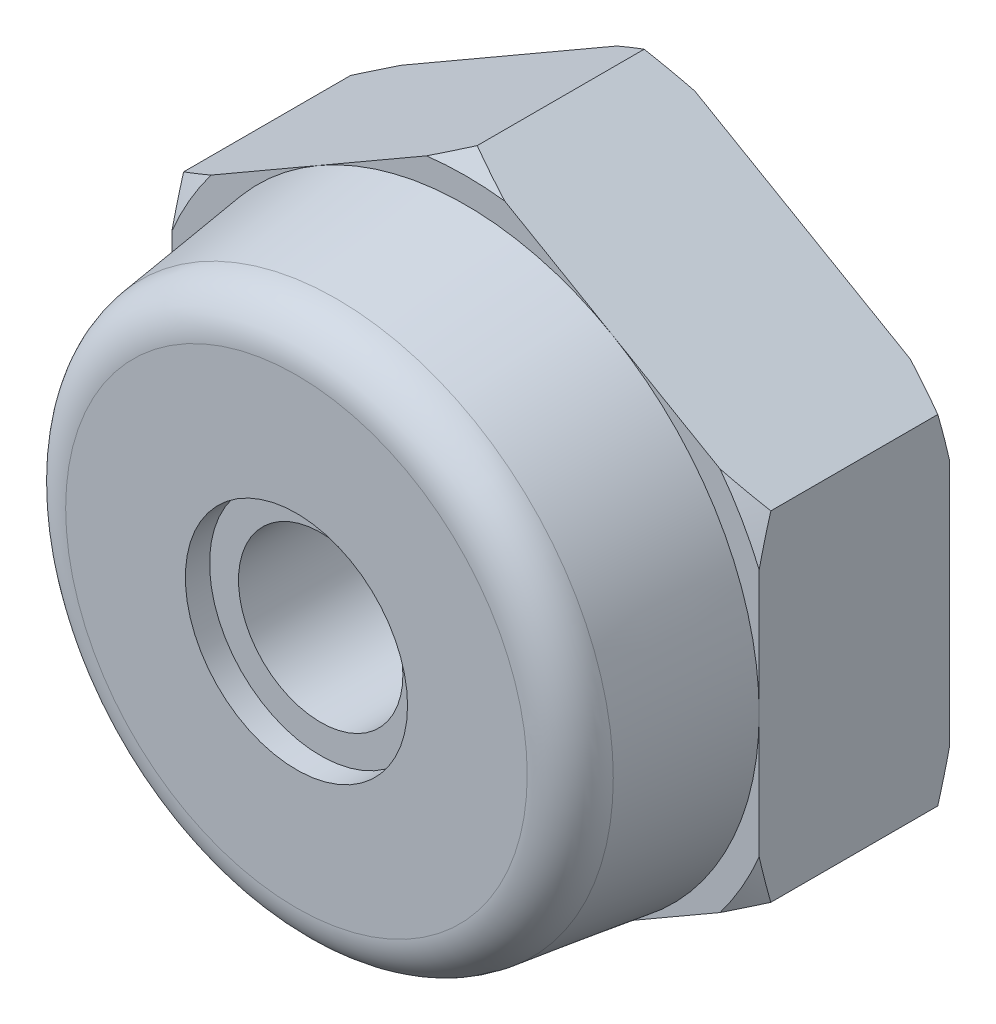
ISO-10303-21;
HEADER;
FILE_DESCRIPTION(('STEP AP214'),'2;1');
FILE_NAME('part.step','',(''),(''),'','','');
FILE_SCHEMA(('AUTOMOTIVE_DESIGN { 1 0 10303 214 1 1 1 1 }'));
ENDSEC;
DATA;
#1=APPLICATION_CONTEXT('core data for automotive mechanical design processes');
#2=APPLICATION_PROTOCOL_DEFINITION('international standard','automotive_design',2000,#1);
#3=PRODUCT_CONTEXT('',#1,'mechanical');
#4=PRODUCT('Part','Part','',(#3));
#5=PRODUCT_RELATED_PRODUCT_CATEGORY('part','',(#4));
#6=PRODUCT_DEFINITION_FORMATION('','',#4);
#7=PRODUCT_DEFINITION_CONTEXT('part definition',#1,'design');
#8=PRODUCT_DEFINITION('design','',#6,#7);
#9=PRODUCT_DEFINITION_SHAPE('','',#8);
#10=(LENGTH_UNIT() NAMED_UNIT(*) SI_UNIT(.MILLI.,.METRE.));
#11=(NAMED_UNIT(*) PLANE_ANGLE_UNIT() SI_UNIT($,.RADIAN.));
#12=(NAMED_UNIT(*) SI_UNIT($,.STERADIAN.) SOLID_ANGLE_UNIT());
#13=UNCERTAINTY_MEASURE_WITH_UNIT(LENGTH_MEASURE(1.E-05),#10,'distance_accuracy_value','');
#14=(GEOMETRIC_REPRESENTATION_CONTEXT(3) GLOBAL_UNCERTAINTY_ASSIGNED_CONTEXT((#13)) GLOBAL_UNIT_ASSIGNED_CONTEXT((#10,
#11,#12)) REPRESENTATION_CONTEXT('',''));
#15=CARTESIAN_POINT('',(0.,0.,0.));
#16=DIRECTION('',(0.,0.,1.));
#17=DIRECTION('',(1.,0.,0.));
#18=AXIS2_PLACEMENT_3D('',#15,#16,#17);
#19=CARTESIAN_POINT('',(3.175,-1.83308710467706,0.));
#20=DIRECTION('',(0.,0.,1.));
#21=DIRECTION('',(1.,0.,0.));
#22=AXIS2_PLACEMENT_3D('',#19,#20,#21);
#23=PLANE('',#22);
#24=DIRECTION('',(0.,1.,0.));
#25=VECTOR('',#24,1.);
#26=CARTESIAN_POINT('',(3.175,-1.83308710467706,0.));
#27=LINE('',#26,#25);
#28=CARTESIAN_POINT('',(3.175,0.,0.));
#29=VERTEX_POINT('',#28);
#30=CARTESIAN_POINT('',(3.175,1.34396658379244,0.));
#31=VERTEX_POINT('',#30);
#32=EDGE_CURVE('E498',#29,#31,#27,.T.);
#33=ORIENTED_EDGE('',*,*,#32,.T.);
#34=CARTESIAN_POINT('',(0.,0.,0.));
#35=DIRECTION('',(0.,0.,1.));
#36=DIRECTION('',(1.,0.,0.));
#37=AXIS2_PLACEMENT_3D('',#34,#35,#36);
#38=CIRCLE('',#37,3.44773420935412);
#39=CARTESIAN_POINT('',(2.75140920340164,2.07764736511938,0.));
#40=VERTEX_POINT('',#39);
#41=EDGE_CURVE('E193',#31,#40,#38,.T.);
#42=ORIENTED_EDGE('',*,*,#41,.T.);
#43=DIRECTION('',(-0.866025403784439,0.5,0.));
#44=VECTOR('',#43,1.);
#45=CARTESIAN_POINT('',(3.175,1.83308710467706,0.));
#46=LINE('',#45,#44);
#47=CARTESIAN_POINT('',(1.5875,2.74963065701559,0.));
#48=VERTEX_POINT('',#47);
#49=EDGE_CURVE('E209',#40,#48,#46,.T.);
#50=ORIENTED_EDGE('',*,*,#49,.T.);
#51=CARTESIAN_POINT('',(0.,0.,0.));
#52=DIRECTION('',(0.,0.,1.));
#53=DIRECTION('',(1.,0.,0.));
#54=AXIS2_PLACEMENT_3D('',#51,#52,#53);
#55=CIRCLE('',#54,3.175);
#56=EDGE_CURVE('E244',#29,#48,#55,.T.);
#57=ORIENTED_EDGE('',*,*,#56,.F.);
#58=EDGE_LOOP('',(#33,#42,#50,#57));
#59=FACE_BOUND('',#58,.T.);
#60=ADVANCED_FACE('F45',(#59),#23,.T.);
#61=CARTESIAN_POINT('',(0.423590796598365,3.42161394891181,0.));
#62=VERTEX_POINT('',#61);
#63=EDGE_CURVE('E502',#48,#62,#46,.T.);
#64=ORIENTED_EDGE('',*,*,#63,.T.);
#65=CARTESIAN_POINT('',(-0.423590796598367,3.42161394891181,0.));
#66=VERTEX_POINT('',#65);
#67=EDGE_CURVE('E468',#62,#66,#38,.T.);
#68=ORIENTED_EDGE('',*,*,#67,.T.);
#69=DIRECTION('',(-0.866025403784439,-0.5,0.));
#70=VECTOR('',#69,1.);
#71=CARTESIAN_POINT('',(0.,3.66617420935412,0.));
#72=LINE('',#71,#70);
#73=CARTESIAN_POINT('',(-1.5875,2.74963065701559,0.));
#74=VERTEX_POINT('',#73);
#75=EDGE_CURVE('E505',#66,#74,#72,.T.);
#76=ORIENTED_EDGE('',*,*,#75,.T.);
#77=EDGE_CURVE('E236',#48,#74,#55,.T.);
#78=ORIENTED_EDGE('',*,*,#77,.F.);
#79=EDGE_LOOP('',(#64,#68,#76,#78));
#80=FACE_BOUND('',#79,.T.);
#81=ADVANCED_FACE('F397',(#80),#23,.T.);
#82=CARTESIAN_POINT('',(-2.75140920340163,2.07764736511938,0.));
#83=VERTEX_POINT('',#82);
#84=EDGE_CURVE('E504',#74,#83,#72,.T.);
#85=ORIENTED_EDGE('',*,*,#84,.T.);
#86=CARTESIAN_POINT('',(-3.175,1.34396658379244,0.));
#87=VERTEX_POINT('',#86);
#88=EDGE_CURVE('E470',#83,#87,#38,.T.);
#89=ORIENTED_EDGE('',*,*,#88,.T.);
#90=DIRECTION('',(0.,-1.,0.));
#91=VECTOR('',#90,1.);
#92=CARTESIAN_POINT('',(-3.175,1.83308710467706,0.));
#93=LINE('',#92,#91);
#94=CARTESIAN_POINT('',(-3.175,0.,0.));
#95=VERTEX_POINT('',#94);
#96=EDGE_CURVE('E298',#87,#95,#93,.T.);
#97=ORIENTED_EDGE('',*,*,#96,.T.);
#98=EDGE_CURVE('E242',#74,#95,#55,.T.);
#99=ORIENTED_EDGE('',*,*,#98,.F.);
#100=EDGE_LOOP('',(#85,#89,#97,#99));
#101=FACE_BOUND('',#100,.T.);
#102=ADVANCED_FACE('F516',(#101),#23,.T.);
#103=CARTESIAN_POINT('',(-3.175,-1.34396658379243,0.));
#104=VERTEX_POINT('',#103);
#105=EDGE_CURVE('E506',#95,#104,#93,.T.);
#106=ORIENTED_EDGE('',*,*,#105,.T.);
#107=CARTESIAN_POINT('',(-2.75140920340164,-2.07764736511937,0.));
#108=VERTEX_POINT('',#107);
#109=EDGE_CURVE('E69',#104,#108,#38,.T.);
#110=ORIENTED_EDGE('',*,*,#109,.T.);
#111=DIRECTION('',(0.866025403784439,-0.5,0.));
#112=VECTOR('',#111,1.);
#113=CARTESIAN_POINT('',(-3.175,-1.83308710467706,0.));
#114=LINE('',#113,#112);
#115=CARTESIAN_POINT('',(-1.5875,-2.74963065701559,0.));
#116=VERTEX_POINT('',#115);
#117=EDGE_CURVE('E275',#108,#116,#114,.T.);
#118=ORIENTED_EDGE('',*,*,#117,.T.);
#119=EDGE_CURVE('E249',#95,#116,#55,.T.);
#120=ORIENTED_EDGE('',*,*,#119,.F.);
#121=EDGE_LOOP('',(#106,#110,#118,#120));
#122=FACE_BOUND('',#121,.T.);
#123=ADVANCED_FACE('F513',(#122),#23,.T.);
#124=CARTESIAN_POINT('',(-0.423590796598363,-3.42161394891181,0.));
#125=VERTEX_POINT('',#124);
#126=EDGE_CURVE('E507',#116,#125,#114,.T.);
#127=ORIENTED_EDGE('',*,*,#126,.T.);
#128=CARTESIAN_POINT('',(0.423590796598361,-3.42161394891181,0.));
#129=VERTEX_POINT('',#128);
#130=EDGE_CURVE('E61',#125,#129,#38,.T.);
#131=ORIENTED_EDGE('',*,*,#130,.T.);
#132=DIRECTION('',(0.866025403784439,0.5,0.));
#133=VECTOR('',#132,1.);
#134=CARTESIAN_POINT('',(0.,-3.66617420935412,0.));
#135=LINE('',#134,#133);
#136=CARTESIAN_POINT('',(1.5875,-2.74963065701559,0.));
#137=VERTEX_POINT('',#136);
#138=EDGE_CURVE('E496',#129,#137,#135,.T.);
#139=ORIENTED_EDGE('',*,*,#138,.T.);
#140=EDGE_CURVE('E262',#116,#137,#55,.T.);
#141=ORIENTED_EDGE('',*,*,#140,.F.);
#142=EDGE_LOOP('',(#127,#131,#139,#141));
#143=FACE_BOUND('',#142,.T.);
#144=ADVANCED_FACE('F619',(#143),#23,.T.);
#145=CARTESIAN_POINT('',(0.,-3.66617420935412,-2.0574));
#146=DIRECTION('',(0.5,-0.866025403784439,0.));
#147=DIRECTION('',(0.866025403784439,0.5,0.));
#148=AXIS2_PLACEMENT_3D('',#145,#146,#147);
#149=PLANE('',#148);
#150=DIRECTION('',(0.,0.,1.));
#151=VECTOR('',#150,1.);
#152=CARTESIAN_POINT('',(3.175,-1.83308710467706,-2.0574));
#153=LINE('',#152,#151);
#154=CARTESIAN_POINT('',(3.175,-1.83308710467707,-1.93128360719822));
#155=VERTEX_POINT('',#154);
#156=CARTESIAN_POINT('',(3.175,-1.83308710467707,-0.126116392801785));
#157=VERTEX_POINT('',#156);
#158=EDGE_CURVE('E217',#155,#157,#153,.T.);
#159=ORIENTED_EDGE('',*,*,#158,.T.);
#160=CARTESIAN_POINT('',(5.37620566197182,-0.562220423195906,-1.13032989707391));
#161=CARTESIAN_POINT('',(5.27647023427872,-0.619802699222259,-1.07652934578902));
#162=CARTESIAN_POINT('',(5.17649581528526,-0.677522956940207,-1.02331043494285));
#163=CARTESIAN_POINT('',(4.97596822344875,-0.793297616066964,-0.918309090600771));
#164=CARTESIAN_POINT('',(4.87541497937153,-0.851352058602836,-0.866526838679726));
#165=CARTESIAN_POINT('',(4.67332926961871,-0.968026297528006,-0.764521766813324));
#166=CARTESIAN_POINT('',(4.57179469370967,-1.02664731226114,-0.714304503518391));
#167=CARTESIAN_POINT('',(4.36796390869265,-1.14432907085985,-0.61597964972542));
#168=CARTESIAN_POINT('',(4.2656677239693,-1.20338980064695,-0.567871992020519));
#169=CARTESIAN_POINT('',(4.05759144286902,-1.32352269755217,-0.473043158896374));
#170=CARTESIAN_POINT('',(3.95178870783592,-1.38460793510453,-0.426387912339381));
#171=CARTESIAN_POINT('',(3.73911374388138,-1.50739588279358,-0.336408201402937));
#172=CARTESIAN_POINT('',(3.63224145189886,-1.5690986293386,-0.293083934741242));
#173=CARTESIAN_POINT('',(3.41740910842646,-1.69313214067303,-0.210594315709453));
#174=CARTESIAN_POINT('',(3.30945026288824,-1.75546220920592,-0.171424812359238));
#175=CARTESIAN_POINT('',(3.09225493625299,-1.88085998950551,-0.0981478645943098));
#176=CARTESIAN_POINT('',(2.98301855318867,-1.943927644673,-0.064040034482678));
#177=CARTESIAN_POINT('',(2.72175397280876,-2.09476882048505,0.00972945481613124));
#178=CARTESIAN_POINT('',(2.56912407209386,-2.18288973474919,0.0466345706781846));
#179=CARTESIAN_POINT('',(2.26173087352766,-2.36036328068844,0.105701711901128));
#180=CARTESIAN_POINT('',(2.10696834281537,-2.44971546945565,0.127868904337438));
#181=CARTESIAN_POINT('',(1.79808495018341,-2.62804937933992,0.154892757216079));
#182=CARTESIAN_POINT('',(1.64397755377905,-2.71702332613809,0.159947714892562));
#183=CARTESIAN_POINT('',(1.33605939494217,-2.89479995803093,0.152675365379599));
#184=CARTESIAN_POINT('',(1.18224865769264,-2.9836026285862,0.140346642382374));
#185=CARTESIAN_POINT('',(0.924453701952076,-3.13244061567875,0.106172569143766));
#186=CARTESIAN_POINT('',(0.820024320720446,-3.19273294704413,0.0885439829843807));
#187=CARTESIAN_POINT('',(0.612150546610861,-3.31274892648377,0.046674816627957));
#188=CARTESIAN_POINT('',(0.508706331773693,-3.37247247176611,0.0224330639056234));
#189=CARTESIAN_POINT('',(0.302837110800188,-3.49133112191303,-0.0317544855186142));
#190=CARTESIAN_POINT('',(0.200413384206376,-3.55046548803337,-0.0617066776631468));
#191=CARTESIAN_POINT('',(-0.00328333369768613,-3.66806984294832,-0.126369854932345));
#192=CARTESIAN_POINT('',(-0.104556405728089,-3.72653987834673,-0.161080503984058));
#193=CARTESIAN_POINT('',(-0.307218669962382,-3.84354699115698,-0.234871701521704));
#194=CARTESIAN_POINT('',(-0.408594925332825,-3.90207659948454,-0.273999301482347));
#195=CARTESIAN_POINT('',(-0.610270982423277,-4.01851432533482,-0.355534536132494));
#196=CARTESIAN_POINT('',(-0.710571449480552,-4.07642282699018,-0.397939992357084));
#197=CARTESIAN_POINT('',(-1.01009876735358,-4.24935500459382,-0.529169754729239));
#198=CARTESIAN_POINT('',(-1.20800238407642,-4.36361471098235,-0.622026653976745));
#199=CARTESIAN_POINT('',(-1.47183202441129,-4.51593682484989,-0.751545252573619));
#200=CARTESIAN_POINT('',(-1.53896810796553,-4.55469786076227,-0.785007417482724));
#201=CARTESIAN_POINT('',(-1.67295075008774,-4.63205277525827,-0.852694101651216));
#202=CARTESIAN_POINT('',(-1.73979731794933,-4.67064665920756,-0.886918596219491));
#203=CARTESIAN_POINT('',(-1.87253480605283,-4.74728268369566,-0.955677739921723));
#204=CARTESIAN_POINT('',(-1.93842843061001,-4.78532638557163,-0.990205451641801));
#205=CARTESIAN_POINT('',(-2.06998468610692,-4.86128042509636,-1.05984642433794));
#206=CARTESIAN_POINT('',(-2.13564731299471,-4.89919076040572,-1.09495969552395));
#207=CARTESIAN_POINT('',(-2.20120566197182,-4.93704089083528,-1.1303298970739));
#208=B_SPLINE_CURVE_WITH_KNOTS('',3,(#160,#161,#162,#163,#164,#165,#166,#167,#168,#169,#170,
#171,#172,#173,#174,#175,#176,#177,#178,#179,#180,#181,#182,#183,#184,#185,#186,#187,#188,#189,
#190,#191,#192,#193,#194,#195,#196,#197,#198,#199,#200,#201,#202,#203,#204,#205,#206,#207),
.UNSPECIFIED.,.F.,.F.,(4,2,2,2,2,2,2,2,2,2,2,2,2,2,2,2,2,2,2,2,2,2,2,4),(0.,0.38133907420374,
0.762726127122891,1.14534092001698,1.52794351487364,1.92023172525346,2.31254320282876,
2.70445895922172,3.09634483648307,3.63602269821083,4.1755112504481,4.70872638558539,
5.24198495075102,5.60739948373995,5.97287884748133,6.33876996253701,6.70463524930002,
7.07485072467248,7.44482223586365,8.18458013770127,8.43788818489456,8.69118803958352,
8.94185107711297,9.1925184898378),.UNSPECIFIED.);
#209=CARTESIAN_POINT('',(2.75140920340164,-2.07764736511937,0.));
#210=VERTEX_POINT('',#209);
#211=EDGE_CURVE('E198',#157,#210,#208,.T.);
#212=ORIENTED_EDGE('',*,*,#211,.T.);
#213=EDGE_CURVE('E499',#137,#210,#135,.T.);
#214=ORIENTED_EDGE('',*,*,#213,.F.);
#215=ORIENTED_EDGE('',*,*,#138,.F.);
#216=CARTESIAN_POINT('',(0.,-3.66617420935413,-0.126116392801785));
#217=VERTEX_POINT('',#216);
#218=EDGE_CURVE('E454',#129,#217,#208,.T.);
#219=ORIENTED_EDGE('',*,*,#218,.T.);
#220=DIRECTION('',(0.,0.,1.));
#221=VECTOR('',#220,1.);
#222=CARTESIAN_POINT('',(0.,-3.66617420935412,-2.0574));
#223=LINE('',#222,#221);
#224=CARTESIAN_POINT('',(0.,-3.66617420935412,-1.93128360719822));
#225=VERTEX_POINT('',#224);
#226=EDGE_CURVE('E263',#225,#217,#223,.T.);
#227=ORIENTED_EDGE('',*,*,#226,.F.);
#228=CARTESIAN_POINT('',(5.37620566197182,-0.562220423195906,-0.927070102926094));
#229=CARTESIAN_POINT('',(5.27647023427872,-0.61980269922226,-0.980870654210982));
#230=CARTESIAN_POINT('',(5.17649581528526,-0.677522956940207,-1.03408956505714));
#231=CARTESIAN_POINT('',(4.97596822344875,-0.793297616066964,-1.13909090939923));
#232=CARTESIAN_POINT('',(4.87541497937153,-0.851352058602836,-1.19087316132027));
#233=CARTESIAN_POINT('',(4.67332926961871,-0.968026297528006,-1.29287823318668));
#234=CARTESIAN_POINT('',(4.57179469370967,-1.02664731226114,-1.34309549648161));
#235=CARTESIAN_POINT('',(4.36796390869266,-1.14432907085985,-1.44142035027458));
#236=CARTESIAN_POINT('',(4.2656677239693,-1.20338980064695,-1.48952800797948));
#237=CARTESIAN_POINT('',(4.05759144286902,-1.32352269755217,-1.58435684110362));
#238=CARTESIAN_POINT('',(3.95178870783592,-1.38460793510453,-1.63101208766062));
#239=CARTESIAN_POINT('',(3.73911374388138,-1.50739588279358,-1.72099179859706));
#240=CARTESIAN_POINT('',(3.63224145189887,-1.5690986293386,-1.76431606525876));
#241=CARTESIAN_POINT('',(3.41740910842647,-1.69313214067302,-1.84680568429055));
#242=CARTESIAN_POINT('',(3.30945026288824,-1.75546220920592,-1.88597518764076));
#243=CARTESIAN_POINT('',(3.09225493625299,-1.88085998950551,-1.95925213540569));
#244=CARTESIAN_POINT('',(2.98301855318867,-1.943927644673,-1.99335996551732));
#245=CARTESIAN_POINT('',(2.72175397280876,-2.09476882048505,-2.06712945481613));
#246=CARTESIAN_POINT('',(2.56912407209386,-2.18288973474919,-2.10403457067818));
#247=CARTESIAN_POINT('',(2.26173087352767,-2.36036328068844,-2.16310171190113));
#248=CARTESIAN_POINT('',(2.10696834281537,-2.44971546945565,-2.18526890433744));
#249=CARTESIAN_POINT('',(1.79808495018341,-2.62804937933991,-2.21229275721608));
#250=CARTESIAN_POINT('',(1.64397755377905,-2.71702332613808,-2.21734771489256));
#251=CARTESIAN_POINT('',(1.33605939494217,-2.89479995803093,-2.2100753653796));
#252=CARTESIAN_POINT('',(1.18224865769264,-2.9836026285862,-2.19774664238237));
#253=CARTESIAN_POINT('',(0.924453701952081,-3.13244061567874,-2.16357256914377));
#254=CARTESIAN_POINT('',(0.820024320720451,-3.19273294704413,-2.14594398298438));
#255=CARTESIAN_POINT('',(0.612150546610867,-3.31274892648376,-2.10407481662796));
#256=CARTESIAN_POINT('',(0.508706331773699,-3.37247247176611,-2.07983306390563));
#257=CARTESIAN_POINT('',(0.302837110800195,-3.49133112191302,-2.02564551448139));
#258=CARTESIAN_POINT('',(0.200413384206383,-3.55046548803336,-1.99569332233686));
#259=CARTESIAN_POINT('',(-0.00328333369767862,-3.66806984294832,-1.93103014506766));
#260=CARTESIAN_POINT('',(-0.104556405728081,-3.72653987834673,-1.89631949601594));
#261=CARTESIAN_POINT('',(-0.307218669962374,-3.84354699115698,-1.8225282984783));
#262=CARTESIAN_POINT('',(-0.408594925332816,-3.90207659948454,-1.78340069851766));
#263=CARTESIAN_POINT('',(-0.610270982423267,-4.01851432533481,-1.70186546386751));
#264=CARTESIAN_POINT('',(-0.710571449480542,-4.07642282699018,-1.65946000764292));
#265=CARTESIAN_POINT('',(-1.01009876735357,-4.24935500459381,-1.52823024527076));
#266=CARTESIAN_POINT('',(-1.2080023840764,-4.36361471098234,-1.43537334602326));
#267=CARTESIAN_POINT('',(-1.47183202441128,-4.51593682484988,-1.30585474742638));
#268=CARTESIAN_POINT('',(-1.53896810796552,-4.55469786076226,-1.27239258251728));
#269=CARTESIAN_POINT('',(-1.67295075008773,-4.63205277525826,-1.20470589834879));
#270=CARTESIAN_POINT('',(-1.73979731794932,-4.67064665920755,-1.17048140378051));
#271=CARTESIAN_POINT('',(-1.87253480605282,-4.74728268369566,-1.10172226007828));
#272=CARTESIAN_POINT('',(-1.93842843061,-4.78532638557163,-1.0671945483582));
#273=CARTESIAN_POINT('',(-2.06998468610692,-4.86128042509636,-0.997553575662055));
#274=CARTESIAN_POINT('',(-2.13564731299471,-4.89919076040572,-0.962440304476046));
#275=CARTESIAN_POINT('',(-2.20120566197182,-4.93704089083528,-0.927070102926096));
#276=B_SPLINE_CURVE_WITH_KNOTS('',3,(#228,#229,#230,#231,#232,#233,#234,#235,#236,#237,#238,
#239,#240,#241,#242,#243,#244,#245,#246,#247,#248,#249,#250,#251,#252,#253,#254,#255,#256,#257,
#258,#259,#260,#261,#262,#263,#264,#265,#266,#267,#268,#269,#270,#271,#272,#273,#274,#275),
.UNSPECIFIED.,.F.,.F.,(4,2,2,2,2,2,2,2,2,2,2,2,2,2,2,2,2,2,2,2,2,2,2,4),(0.,0.381339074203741,
0.762726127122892,1.14534092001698,1.52794351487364,1.92023172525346,2.31254320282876,
2.70445895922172,3.09634483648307,3.63602269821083,4.1755112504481,4.70872638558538,
5.24198495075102,5.60739948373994,5.97287884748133,6.33876996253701,6.70463524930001,
7.07485072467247,7.44482223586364,8.18458013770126,8.43788818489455,8.69118803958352,
8.94185107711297,9.1925184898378),.UNSPECIFIED.);
#277=CARTESIAN_POINT('',(0.423590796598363,-3.42161394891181,-2.0574));
#278=VERTEX_POINT('',#277);
#279=EDGE_CURVE('E253',#278,#225,#276,.T.);
#280=ORIENTED_EDGE('',*,*,#279,.F.);
#281=DIRECTION('',(0.866025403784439,0.5,0.));
#282=VECTOR('',#281,1.);
#283=CARTESIAN_POINT('',(0.,-3.66617420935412,-2.0574));
#284=LINE('',#283,#282);
#285=CARTESIAN_POINT('',(2.75140920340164,-2.07764736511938,-2.0574));
#286=VERTEX_POINT('',#285);
#287=EDGE_CURVE('E484',#278,#286,#284,.T.);
#288=ORIENTED_EDGE('',*,*,#287,.T.);
#289=EDGE_CURVE('E261',#155,#286,#276,.T.);
#290=ORIENTED_EDGE('',*,*,#289,.F.);
#291=EDGE_LOOP('',(#159,#212,#214,#215,#219,#227,#280,#288,#290));
#292=FACE_BOUND('',#291,.T.);
#293=ADVANCED_FACE('F47',(#292),#149,.T.);
#294=CARTESIAN_POINT('',(-3.175,-1.83308710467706,-2.0574));
#295=DIRECTION('',(-0.5,-0.866025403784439,0.));
#296=DIRECTION('',(0.866025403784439,-0.5,0.));
#297=AXIS2_PLACEMENT_3D('',#294,#295,#296);
#298=PLANE('',#297);
#299=ORIENTED_EDGE('',*,*,#226,.T.);
#300=CARTESIAN_POINT('',(2.20120566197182,-4.93704089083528,-1.13032989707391));
#301=CARTESIAN_POINT('',(2.10147023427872,-4.87945861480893,-1.07652934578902));
#302=CARTESIAN_POINT('',(2.00149581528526,-4.82173835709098,-1.02331043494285));
#303=CARTESIAN_POINT('',(1.80096822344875,-4.70596369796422,-0.918309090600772));
#304=CARTESIAN_POINT('',(1.70041497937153,-4.64790925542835,-0.866526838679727));
#305=CARTESIAN_POINT('',(1.49832926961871,-4.53123501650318,-0.764521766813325));
#306=CARTESIAN_POINT('',(1.39679469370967,-4.47261400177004,-0.714304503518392));
#307=CARTESIAN_POINT('',(1.19296390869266,-4.35493224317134,-0.615979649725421));
#308=CARTESIAN_POINT('',(1.0906677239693,-4.29587151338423,-0.567871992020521));
#309=CARTESIAN_POINT('',(0.882591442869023,-4.17573861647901,-0.473043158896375));
#310=CARTESIAN_POINT('',(0.776788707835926,-4.11465337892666,-0.426387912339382));
#311=CARTESIAN_POINT('',(0.564113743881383,-3.99186543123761,-0.336408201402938));
#312=CARTESIAN_POINT('',(0.457241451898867,-3.93016268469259,-0.293083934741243));
#313=CARTESIAN_POINT('',(0.242409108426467,-3.80612917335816,-0.210594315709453));
#314=CARTESIAN_POINT('',(0.134450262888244,-3.74379910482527,-0.171424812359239));
#315=CARTESIAN_POINT('',(-0.0827450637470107,-3.61840132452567,-0.0981478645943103));
#316=CARTESIAN_POINT('',(-0.191981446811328,-3.55533366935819,-0.0640400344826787));
#317=CARTESIAN_POINT('',(-0.453246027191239,-3.40449249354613,0.00972945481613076));
#318=CARTESIAN_POINT('',(-0.605875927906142,-3.316371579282,0.0466345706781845));
#319=CARTESIAN_POINT('',(-0.913269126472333,-3.13889803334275,0.105701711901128));
#320=CARTESIAN_POINT('',(-1.06803165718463,-3.04954584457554,0.127868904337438));
#321=CARTESIAN_POINT('',(-1.37691504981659,-2.87121193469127,0.154892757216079));
#322=CARTESIAN_POINT('',(-1.53102244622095,-2.7822379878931,0.159947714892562));
#323=CARTESIAN_POINT('',(-1.83894060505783,-2.60446135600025,0.152675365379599));
#324=CARTESIAN_POINT('',(-1.99275134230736,-2.51565868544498,0.140346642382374));
#325=CARTESIAN_POINT('',(-2.25054629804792,-2.36682069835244,0.106172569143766));
#326=CARTESIAN_POINT('',(-2.35497567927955,-2.30652836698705,0.0885439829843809));
#327=CARTESIAN_POINT('',(-2.56284945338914,-2.18651238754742,0.0466748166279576));
#328=CARTESIAN_POINT('',(-2.6662936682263,-2.12678884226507,0.022433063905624));
#329=CARTESIAN_POINT('',(-2.87216288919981,-2.00793019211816,-0.0317544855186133));
#330=CARTESIAN_POINT('',(-2.97458661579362,-1.94879582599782,-0.0617066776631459));
#331=CARTESIAN_POINT('',(-3.17828333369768,-1.83119147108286,-0.126369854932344));
#332=CARTESIAN_POINT('',(-3.27955640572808,-1.77272143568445,-0.161080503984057));
#333=CARTESIAN_POINT('',(-3.48221866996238,-1.6557143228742,-0.234871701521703));
#334=CARTESIAN_POINT('',(-3.58359492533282,-1.59718471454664,-0.273999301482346));
#335=CARTESIAN_POINT('',(-3.78527098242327,-1.48074698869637,-0.355534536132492));
#336=CARTESIAN_POINT('',(-3.88557144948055,-1.422838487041,-0.397939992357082));
#337=CARTESIAN_POINT('',(-4.18509876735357,-1.24990630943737,-0.529169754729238));
#338=CARTESIAN_POINT('',(-4.38300238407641,-1.13564660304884,-0.622026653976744));
#339=CARTESIAN_POINT('',(-4.64683202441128,-0.983324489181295,-0.751545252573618));
#340=CARTESIAN_POINT('',(-4.71396810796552,-0.944563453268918,-0.785007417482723));
#341=CARTESIAN_POINT('',(-4.84795075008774,-0.867208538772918,-0.852694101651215));
#342=CARTESIAN_POINT('',(-4.91479731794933,-0.828614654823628,-0.886918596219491));
#343=CARTESIAN_POINT('',(-5.04753480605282,-0.751978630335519,-0.955677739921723));
#344=CARTESIAN_POINT('',(-5.11342843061,-0.713934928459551,-0.990205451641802));
#345=CARTESIAN_POINT('',(-5.24498468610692,-0.637980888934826,-1.05984642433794));
#346=CARTESIAN_POINT('',(-5.31064731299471,-0.600070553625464,-1.09495969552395));
#347=CARTESIAN_POINT('',(-5.37620566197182,-0.562220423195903,-1.1303298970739));
#348=B_SPLINE_CURVE_WITH_KNOTS('',3,(#300,#301,#302,#303,#304,#305,#306,#307,#308,#309,#310,
#311,#312,#313,#314,#315,#316,#317,#318,#319,#320,#321,#322,#323,#324,#325,#326,#327,#328,#329,
#330,#331,#332,#333,#334,#335,#336,#337,#338,#339,#340,#341,#342,#343,#344,#345,#346,#347),
.UNSPECIFIED.,.F.,.F.,(4,2,2,2,2,2,2,2,2,2,2,2,2,2,2,2,2,2,2,2,2,2,2,4),(0.,0.38133907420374,
0.762726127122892,1.14534092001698,1.52794351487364,1.92023172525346,2.31254320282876,
2.70445895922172,3.09634483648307,3.63602269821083,4.1755112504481,4.70872638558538,
5.24198495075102,5.60739948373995,5.97287884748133,6.33876996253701,6.70463524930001,
7.07485072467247,7.44482223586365,8.18458013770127,8.43788818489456,8.69118803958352,
8.94185107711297,9.1925184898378),.UNSPECIFIED.);
#349=EDGE_CURVE('E461',#217,#125,#348,.T.);
#350=ORIENTED_EDGE('',*,*,#349,.T.);
#351=ORIENTED_EDGE('',*,*,#126,.F.);
#352=ORIENTED_EDGE('',*,*,#117,.F.);
#353=CARTESIAN_POINT('',(-3.175,-1.83308710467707,-0.126116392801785));
#354=VERTEX_POINT('',#353);
#355=EDGE_CURVE('E303',#108,#354,#348,.T.);
#356=ORIENTED_EDGE('',*,*,#355,.T.);
#357=DIRECTION('',(0.,0.,1.));
#358=VECTOR('',#357,1.);
#359=CARTESIAN_POINT('',(-3.175,-1.83308710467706,-2.0574));
#360=LINE('',#359,#358);
#361=CARTESIAN_POINT('',(-3.175,-1.83308710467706,-1.93128360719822));
#362=VERTEX_POINT('',#361);
#363=EDGE_CURVE('E267',#362,#354,#360,.T.);
#364=ORIENTED_EDGE('',*,*,#363,.F.);
#365=CARTESIAN_POINT('',(2.20120566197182,-4.93704089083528,-0.927070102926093));
#366=CARTESIAN_POINT('',(2.10147023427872,-4.87945861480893,-0.980870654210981));
#367=CARTESIAN_POINT('',(2.00149581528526,-4.82173835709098,-1.03408956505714));
#368=CARTESIAN_POINT('',(1.80096822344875,-4.70596369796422,-1.13909090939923));
#369=CARTESIAN_POINT('',(1.70041497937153,-4.64790925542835,-1.19087316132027));
#370=CARTESIAN_POINT('',(1.49832926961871,-4.53123501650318,-1.29287823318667));
#371=CARTESIAN_POINT('',(1.39679469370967,-4.47261400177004,-1.34309549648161));
#372=CARTESIAN_POINT('',(1.19296390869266,-4.35493224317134,-1.44142035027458));
#373=CARTESIAN_POINT('',(1.0906677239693,-4.29587151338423,-1.48952800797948));
#374=CARTESIAN_POINT('',(0.882591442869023,-4.17573861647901,-1.58435684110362));
#375=CARTESIAN_POINT('',(0.776788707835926,-4.11465337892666,-1.63101208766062));
#376=CARTESIAN_POINT('',(0.564113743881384,-3.99186543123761,-1.72099179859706));
#377=CARTESIAN_POINT('',(0.457241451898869,-3.93016268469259,-1.76431606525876));
#378=CARTESIAN_POINT('',(0.242409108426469,-3.80612917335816,-1.84680568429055));
#379=CARTESIAN_POINT('',(0.134450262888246,-3.74379910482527,-1.88597518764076));
#380=CARTESIAN_POINT('',(-0.082745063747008,-3.61840132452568,-1.95925213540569));
#381=CARTESIAN_POINT('',(-0.191981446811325,-3.55533366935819,-1.99335996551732));
#382=CARTESIAN_POINT('',(-0.453246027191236,-3.40449249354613,-2.06712945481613));
#383=CARTESIAN_POINT('',(-0.605875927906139,-3.316371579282,-2.10403457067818));
#384=CARTESIAN_POINT('',(-0.913269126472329,-3.13889803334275,-2.16310171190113));
#385=CARTESIAN_POINT('',(-1.06803165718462,-3.04954584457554,-2.18526890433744));
#386=CARTESIAN_POINT('',(-1.37691504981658,-2.87121193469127,-2.21229275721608));
#387=CARTESIAN_POINT('',(-1.53102244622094,-2.7822379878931,-2.21734771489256));
#388=CARTESIAN_POINT('',(-1.83894060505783,-2.60446135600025,-2.2100753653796));
#389=CARTESIAN_POINT('',(-1.99275134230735,-2.51565868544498,-2.19774664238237));
#390=CARTESIAN_POINT('',(-2.25054629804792,-2.36682069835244,-2.16357256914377));
#391=CARTESIAN_POINT('',(-2.35497567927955,-2.30652836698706,-2.14594398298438));
#392=CARTESIAN_POINT('',(-2.56284945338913,-2.18651238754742,-2.10407481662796));
#393=CARTESIAN_POINT('',(-2.6662936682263,-2.12678884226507,-2.07983306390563));
#394=CARTESIAN_POINT('',(-2.8721628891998,-2.00793019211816,-2.02564551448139));
#395=CARTESIAN_POINT('',(-2.97458661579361,-1.94879582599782,-1.99569332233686));
#396=CARTESIAN_POINT('',(-3.17828333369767,-1.83119147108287,-1.93103014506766));
#397=CARTESIAN_POINT('',(-3.27955640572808,-1.77272143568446,-1.89631949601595));
#398=CARTESIAN_POINT('',(-3.48221866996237,-1.65571432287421,-1.8225282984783));
#399=CARTESIAN_POINT('',(-3.58359492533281,-1.59718471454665,-1.78340069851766));
#400=CARTESIAN_POINT('',(-3.78527098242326,-1.48074698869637,-1.70186546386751));
#401=CARTESIAN_POINT('',(-3.88557144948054,-1.42283848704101,-1.65946000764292));
#402=CARTESIAN_POINT('',(-4.18509876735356,-1.24990630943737,-1.52823024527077));
#403=CARTESIAN_POINT('',(-4.3830023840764,-1.13564660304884,-1.43537334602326));
#404=CARTESIAN_POINT('',(-4.64683202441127,-0.983324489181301,-1.30585474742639));
#405=CARTESIAN_POINT('',(-4.71396810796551,-0.944563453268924,-1.27239258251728));
#406=CARTESIAN_POINT('',(-4.84795075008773,-0.867208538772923,-1.20470589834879));
#407=CARTESIAN_POINT('',(-4.91479731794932,-0.828614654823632,-1.17048140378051));
#408=CARTESIAN_POINT('',(-5.04753480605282,-0.751978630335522,-1.10172226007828));
#409=CARTESIAN_POINT('',(-5.11342843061,-0.713934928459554,-1.0671945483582));
#410=CARTESIAN_POINT('',(-5.24498468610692,-0.637980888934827,-0.997553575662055));
#411=CARTESIAN_POINT('',(-5.31064731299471,-0.600070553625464,-0.962440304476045));
#412=CARTESIAN_POINT('',(-5.37620566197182,-0.562220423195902,-0.927070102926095));
#413=B_SPLINE_CURVE_WITH_KNOTS('',3,(#365,#366,#367,#368,#369,#370,#371,#372,#373,#374,#375,
#376,#377,#378,#379,#380,#381,#382,#383,#384,#385,#386,#387,#388,#389,#390,#391,#392,#393,#394,
#395,#396,#397,#398,#399,#400,#401,#402,#403,#404,#405,#406,#407,#408,#409,#410,#411,#412),
.UNSPECIFIED.,.F.,.F.,(4,2,2,2,2,2,2,2,2,2,2,2,2,2,2,2,2,2,2,2,2,2,2,4),(0.,0.38133907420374,
0.762726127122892,1.14534092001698,1.52794351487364,1.92023172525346,2.31254320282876,
2.70445895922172,3.09634483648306,3.63602269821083,4.1755112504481,4.70872638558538,
5.24198495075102,5.60739948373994,5.97287884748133,6.338769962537,6.70463524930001,
7.07485072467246,7.44482223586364,8.18458013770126,8.43788818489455,8.69118803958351,
8.94185107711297,9.19251848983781),.UNSPECIFIED.);
#414=CARTESIAN_POINT('',(-2.75140920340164,-2.07764736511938,-2.0574));
#415=VERTEX_POINT('',#414);
#416=EDGE_CURVE('E385',#415,#362,#413,.T.);
#417=ORIENTED_EDGE('',*,*,#416,.F.);
#418=DIRECTION('',(0.866025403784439,-0.5,0.));
#419=VECTOR('',#418,1.);
#420=CARTESIAN_POINT('',(-3.175,-1.83308710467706,-2.0574));
#421=LINE('',#420,#419);
#422=CARTESIAN_POINT('',(-0.423590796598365,-3.42161394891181,-2.0574));
#423=VERTEX_POINT('',#422);
#424=EDGE_CURVE('E222',#415,#423,#421,.T.);
#425=ORIENTED_EDGE('',*,*,#424,.T.);
#426=EDGE_CURVE('E259',#225,#423,#413,.T.);
#427=ORIENTED_EDGE('',*,*,#426,.F.);
#428=EDGE_LOOP('',(#299,#350,#351,#352,#356,#364,#417,#425,#427));
#429=FACE_BOUND('',#428,.T.);
#430=ADVANCED_FACE('F390',(#429),#298,.T.);
#431=CARTESIAN_POINT('',(-3.175,1.83308710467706,-2.0574));
#432=DIRECTION('',(-1.,0.,0.));
#433=DIRECTION('',(0.,-1.,0.));
#434=AXIS2_PLACEMENT_3D('',#431,#432,#433);
#435=PLANE('',#434);
#436=ORIENTED_EDGE('',*,*,#363,.T.);
#437=CARTESIAN_POINT('',(-3.175,-4.03429276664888,-0.973464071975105));
#438=CARTESIAN_POINT('',(-3.175,-3.91960402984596,-0.92144405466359));
#439=CARTESIAN_POINT('',(-3.175,-3.80460134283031,-0.87010339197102));
#440=CARTESIAN_POINT('',(-3.175,-3.57383321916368,-0.76911030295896));
#441=CARTESIAN_POINT('',(-3.175,-3.45806764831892,-0.719458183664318));
#442=CARTESIAN_POINT('',(-3.175,-3.22519372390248,-0.621987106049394));
#443=CARTESIAN_POINT('',(-3.175,-3.10808177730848,-0.574176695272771));
#444=CARTESIAN_POINT('',(-3.175,-2.87286811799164,-0.481066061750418));
#445=CARTESIAN_POINT('',(-3.175,-2.75476645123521,-0.435765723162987));
#446=CARTESIAN_POINT('',(-3.175,-2.51796094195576,-0.348430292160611));
#447=CARTESIAN_POINT('',(-3.175,-2.39926228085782,-0.306381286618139));
#448=CARTESIAN_POINT('',(-3.175,-2.160611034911,-0.22601439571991));
#449=CARTESIAN_POINT('',(-3.175,-2.04065837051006,-0.187696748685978));
#450=CARTESIAN_POINT('',(-3.175,-1.67904679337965,-0.0796555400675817));
#451=CARTESIAN_POINT('',(-3.175,-1.43524394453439,-0.0166942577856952));
#452=CARTESIAN_POINT('',(-3.175,-1.01195042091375,0.0689736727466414));
#453=CARTESIAN_POINT('',(-3.175,-0.833764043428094,0.0980285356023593));
#454=CARTESIAN_POINT('',(-3.175,-0.475468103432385,0.13978518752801));
#455=CARTESIAN_POINT('',(-3.175,-0.295359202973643,0.152492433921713));
#456=CARTESIAN_POINT('',(-3.175,0.065155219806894,0.160025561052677));
#457=CARTESIAN_POINT('',(-3.175,0.245560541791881,0.154860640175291));
#458=CARTESIAN_POINT('',(-3.175,0.605020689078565,0.127321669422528));
#459=CARTESIAN_POINT('',(-3.175,0.784075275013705,0.104944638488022));
#460=CARTESIAN_POINT('',(-3.175,1.22789001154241,0.0306696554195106));
#461=CARTESIAN_POINT('',(-3.175,1.49110281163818,-0.0303661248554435));
#462=CARTESIAN_POINT('',(-3.175,1.88112764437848,-0.139100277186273));
#463=CARTESIAN_POINT('',(-3.175,2.01050435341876,-0.178271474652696));
#464=CARTESIAN_POINT('',(-3.175,2.26776417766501,-0.261264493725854));
#465=CARTESIAN_POINT('',(-3.175,2.39564739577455,-0.305085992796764));
#466=CARTESIAN_POINT('',(-3.175,2.6514940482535,-0.39697960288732));
#467=CARTESIAN_POINT('',(-3.175,2.77944205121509,-0.445094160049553));
#468=CARTESIAN_POINT('',(-3.175,3.03414583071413,-0.544395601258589));
#469=CARTESIAN_POINT('',(-3.175,3.16090153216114,-0.595582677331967));
#470=CARTESIAN_POINT('',(-3.175,3.41260387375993,-0.700104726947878));
#471=CARTESIAN_POINT('',(-3.175,3.53755684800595,-0.753424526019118));
#472=CARTESIAN_POINT('',(-3.175,3.78655868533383,-0.862056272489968));
#473=CARTESIAN_POINT('',(-3.175,3.91060776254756,-0.917367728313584));
#474=CARTESIAN_POINT('',(-3.175,4.03429276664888,-0.973464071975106));
#475=B_SPLINE_CURVE_WITH_KNOTS('',3,(#437,#438,#439,#440,#441,#442,#443,#444,#445,#446,#447,
#448,#449,#450,#451,#452,#453,#454,#455,#456,#457,#458,#459,#460,#461,#462,#463,#464,#465,#466,
#467,#468,#469,#470,#471,#472,#473,#474),.UNSPECIFIED.,.F.,.F.,(4,2,2,2,2,2,2,2,2,2,2,2,2,2,2,2,
2,2,4),(0.,0.377810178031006,0.755688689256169,1.13514965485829,1.51459309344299,
1.89231085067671,2.27005271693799,3.02428474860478,3.56528719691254,4.10610899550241,
4.64665248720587,5.18728961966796,5.99612403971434,6.40161249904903,6.80707285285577,
7.21711612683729,7.62718505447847,8.03472779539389,8.44217062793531),.UNSPECIFIED.);
#476=EDGE_CURVE('E301',#354,#104,#475,.T.);
#477=ORIENTED_EDGE('',*,*,#476,.T.);
#478=ORIENTED_EDGE('',*,*,#105,.F.);
#479=ORIENTED_EDGE('',*,*,#96,.F.);
#480=CARTESIAN_POINT('',(-3.175,1.83308710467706,-0.126116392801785));
#481=VERTEX_POINT('',#480);
#482=EDGE_CURVE('E296',#87,#481,#475,.T.);
#483=ORIENTED_EDGE('',*,*,#482,.T.);
#484=DIRECTION('',(0.,0.,1.));
#485=VECTOR('',#484,1.);
#486=CARTESIAN_POINT('',(-3.175,1.83308710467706,-2.0574));
#487=LINE('',#486,#485);
#488=CARTESIAN_POINT('',(-3.175,1.83308710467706,-1.93128360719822));
#489=VERTEX_POINT('',#488);
#490=EDGE_CURVE('E219',#489,#481,#487,.T.);
#491=ORIENTED_EDGE('',*,*,#490,.F.);
#492=CARTESIAN_POINT('',(-3.175,-4.03429276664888,-1.08393592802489));
#493=CARTESIAN_POINT('',(-3.175,-3.91960402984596,-1.13595594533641));
#494=CARTESIAN_POINT('',(-3.175,-3.80460134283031,-1.18729660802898));
#495=CARTESIAN_POINT('',(-3.175,-3.57383321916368,-1.28828969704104));
#496=CARTESIAN_POINT('',(-3.175,-3.45806764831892,-1.33794181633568));
#497=CARTESIAN_POINT('',(-3.175,-3.22519372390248,-1.43541289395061));
#498=CARTESIAN_POINT('',(-3.175,-3.10808177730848,-1.48322330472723));
#499=CARTESIAN_POINT('',(-3.175,-2.87286811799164,-1.57633393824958));
#500=CARTESIAN_POINT('',(-3.175,-2.75476645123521,-1.62163427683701));
#501=CARTESIAN_POINT('',(-3.175,-2.51796094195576,-1.70896970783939));
#502=CARTESIAN_POINT('',(-3.175,-2.39926228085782,-1.75101871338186));
#503=CARTESIAN_POINT('',(-3.175,-2.160611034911,-1.83138560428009));
#504=CARTESIAN_POINT('',(-3.175,-2.04065837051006,-1.86970325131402));
#505=CARTESIAN_POINT('',(-3.175,-1.67904679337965,-1.97774445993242));
#506=CARTESIAN_POINT('',(-3.175,-1.4352439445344,-2.0407057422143));
#507=CARTESIAN_POINT('',(-3.175,-1.01195042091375,-2.12637367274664));
#508=CARTESIAN_POINT('',(-3.175,-0.833764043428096,-2.15542853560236));
#509=CARTESIAN_POINT('',(-3.175,-0.475468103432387,-2.19718518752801));
#510=CARTESIAN_POINT('',(-3.175,-0.295359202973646,-2.20989243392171));
#511=CARTESIAN_POINT('',(-3.175,0.0651552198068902,-2.21742556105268));
#512=CARTESIAN_POINT('',(-3.175,0.245560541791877,-2.21226064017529));
#513=CARTESIAN_POINT('',(-3.175,0.60502068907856,-2.18472166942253));
#514=CARTESIAN_POINT('',(-3.175,0.784075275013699,-2.16234463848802));
#515=CARTESIAN_POINT('',(-3.175,1.2278900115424,-2.08806965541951));
#516=CARTESIAN_POINT('',(-3.175,1.49110281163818,-2.02703387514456));
#517=CARTESIAN_POINT('',(-3.175,1.88112764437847,-1.91829972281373));
#518=CARTESIAN_POINT('',(-3.175,2.01050435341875,-1.87912852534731));
#519=CARTESIAN_POINT('',(-3.175,2.26776417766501,-1.79613550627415));
#520=CARTESIAN_POINT('',(-3.175,2.39564739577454,-1.75231400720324));
#521=CARTESIAN_POINT('',(-3.175,2.65149404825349,-1.66042039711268));
#522=CARTESIAN_POINT('',(-3.175,2.77944205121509,-1.61230583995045));
#523=CARTESIAN_POINT('',(-3.175,3.03414583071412,-1.51300439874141));
#524=CARTESIAN_POINT('',(-3.175,3.16090153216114,-1.46181732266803));
#525=CARTESIAN_POINT('',(-3.175,3.41260387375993,-1.35729527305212));
#526=CARTESIAN_POINT('',(-3.175,3.53755684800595,-1.30397547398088));
#527=CARTESIAN_POINT('',(-3.175,3.78655868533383,-1.19534372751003));
#528=CARTESIAN_POINT('',(-3.175,3.91060776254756,-1.14003227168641));
#529=CARTESIAN_POINT('',(-3.175,4.03429276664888,-1.08393592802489));
#530=B_SPLINE_CURVE_WITH_KNOTS('',3,(#492,#493,#494,#495,#496,#497,#498,#499,#500,#501,#502,
#503,#504,#505,#506,#507,#508,#509,#510,#511,#512,#513,#514,#515,#516,#517,#518,#519,#520,#521,
#522,#523,#524,#525,#526,#527,#528,#529),.UNSPECIFIED.,.F.,.F.,(4,2,2,2,2,2,2,2,2,2,2,2,2,2,2,2,
2,2,4),(0.,0.377810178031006,0.755688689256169,1.13514965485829,1.51459309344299,
1.89231085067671,2.27005271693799,3.02428474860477,3.56528719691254,4.10610899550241,
4.64665248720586,5.18728961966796,5.99612403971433,6.40161249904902,6.80707285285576,
7.21711612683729,7.62718505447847,8.03472779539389,8.44217062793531),.UNSPECIFIED.);
#531=CARTESIAN_POINT('',(-3.175,1.34396658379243,-2.0574));
#532=VERTEX_POINT('',#531);
#533=EDGE_CURVE('E293',#532,#489,#530,.T.);
#534=ORIENTED_EDGE('',*,*,#533,.F.);
#535=DIRECTION('',(0.,-1.,0.));
#536=VECTOR('',#535,1.);
#537=CARTESIAN_POINT('',(-3.175,1.83308710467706,-2.0574));
#538=LINE('',#537,#536);
#539=CARTESIAN_POINT('',(-3.175,-1.34396658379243,-2.0574));
#540=VERTEX_POINT('',#539);
#541=EDGE_CURVE('E492',#532,#540,#538,.T.);
#542=ORIENTED_EDGE('',*,*,#541,.T.);
#543=EDGE_CURVE('E384',#362,#540,#530,.T.);
#544=ORIENTED_EDGE('',*,*,#543,.F.);
#545=EDGE_LOOP('',(#436,#477,#478,#479,#483,#491,#534,#542,#544));
#546=FACE_BOUND('',#545,.T.);
#547=ADVANCED_FACE('F291',(#546),#435,.T.);
#548=CARTESIAN_POINT('',(0.,3.66617420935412,-2.0574));
#549=DIRECTION('',(-0.5,0.866025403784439,0.));
#550=DIRECTION('',(-0.866025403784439,-0.5,0.));
#551=AXIS2_PLACEMENT_3D('',#548,#549,#550);
#552=PLANE('',#551);
#553=ORIENTED_EDGE('',*,*,#490,.T.);
#554=CARTESIAN_POINT('',(-5.37620566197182,0.562220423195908,-1.13032989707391));
#555=CARTESIAN_POINT('',(-5.27647023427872,0.619802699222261,-1.07652934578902));
#556=CARTESIAN_POINT('',(-5.17649581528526,0.677522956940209,-1.02331043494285));
#557=CARTESIAN_POINT('',(-4.97596822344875,0.793297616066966,-0.918309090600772));
#558=CARTESIAN_POINT('',(-4.87541497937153,0.851352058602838,-0.866526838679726));
#559=CARTESIAN_POINT('',(-4.67332926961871,0.968026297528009,-0.764521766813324));
#560=CARTESIAN_POINT('',(-4.57179469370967,1.02664731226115,-0.714304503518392));
#561=CARTESIAN_POINT('',(-4.36796390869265,1.14432907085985,-0.61597964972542));
#562=CARTESIAN_POINT('',(-4.2656677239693,1.20338980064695,-0.56787199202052));
#563=CARTESIAN_POINT('',(-4.05759144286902,1.32352269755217,-0.473043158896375));
#564=CARTESIAN_POINT('',(-3.95178870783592,1.38460793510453,-0.426387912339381));
#565=CARTESIAN_POINT('',(-3.73911374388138,1.50739588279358,-0.336408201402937));
#566=CARTESIAN_POINT('',(-3.63224145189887,1.5690986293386,-0.293083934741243));
#567=CARTESIAN_POINT('',(-3.41740910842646,1.69313214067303,-0.210594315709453));
#568=CARTESIAN_POINT('',(-3.30945026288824,1.75546220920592,-0.171424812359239));
#569=CARTESIAN_POINT('',(-3.09225493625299,1.88085998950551,-0.09814786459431));
#570=CARTESIAN_POINT('',(-2.98301855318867,1.943927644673,-0.0640400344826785));
#571=CARTESIAN_POINT('',(-2.72175397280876,2.09476882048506,0.00972945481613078));
#572=CARTESIAN_POINT('',(-2.56912407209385,2.18288973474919,0.0466345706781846));
#573=CARTESIAN_POINT('',(-2.26173087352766,2.36036328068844,0.105701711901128));
#574=CARTESIAN_POINT('',(-2.10696834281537,2.44971546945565,0.127868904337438));
#575=CARTESIAN_POINT('',(-1.79808495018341,2.62804937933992,0.154892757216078));
#576=CARTESIAN_POINT('',(-1.64397755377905,2.71702332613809,0.159947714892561));
#577=CARTESIAN_POINT('',(-1.33605939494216,2.89479995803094,0.152675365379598));
#578=CARTESIAN_POINT('',(-1.18224865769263,2.98360262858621,0.140346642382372));
#579=CARTESIAN_POINT('',(-0.924453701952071,3.13244061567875,0.106172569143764));
#580=CARTESIAN_POINT('',(-0.820024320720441,3.19273294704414,0.0885439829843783));
#581=CARTESIAN_POINT('',(-0.612150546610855,3.31274892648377,0.0466748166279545));
#582=CARTESIAN_POINT('',(-0.508706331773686,3.37247247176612,0.0224330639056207));
#583=CARTESIAN_POINT('',(-0.302837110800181,3.49133112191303,-0.0317544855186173));
#584=CARTESIAN_POINT('',(-0.200413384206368,3.55046548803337,-0.0617066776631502));
#585=CARTESIAN_POINT('',(0.00328333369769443,3.66806984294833,-0.126369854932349));
#586=CARTESIAN_POINT('',(0.104556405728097,3.72653987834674,-0.161080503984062));
#587=CARTESIAN_POINT('',(0.307218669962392,3.84354699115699,-0.234871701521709));
#588=CARTESIAN_POINT('',(0.408594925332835,3.90207659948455,-0.273999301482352));
#589=CARTESIAN_POINT('',(0.610270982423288,4.01851432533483,-0.355534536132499));
#590=CARTESIAN_POINT('',(0.710571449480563,4.07642282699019,-0.39793999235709));
#591=CARTESIAN_POINT('',(1.01009876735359,4.24935500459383,-0.529169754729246));
#592=CARTESIAN_POINT('',(1.20800238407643,4.36361471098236,-0.622026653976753));
#593=CARTESIAN_POINT('',(1.4718320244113,4.5159368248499,-0.751545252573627));
#594=CARTESIAN_POINT('',(1.53896810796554,4.55469786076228,-0.785007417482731));
#595=CARTESIAN_POINT('',(1.67295075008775,4.63205277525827,-0.852694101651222));
#596=CARTESIAN_POINT('',(1.73979731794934,4.67064665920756,-0.886918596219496));
#597=CARTESIAN_POINT('',(1.87253480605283,4.74728268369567,-0.955677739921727));
#598=CARTESIAN_POINT('',(1.93842843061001,4.78532638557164,-0.990205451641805));
#599=CARTESIAN_POINT('',(2.06998468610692,4.86128042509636,-1.05984642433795));
#600=CARTESIAN_POINT('',(2.13564731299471,4.89919076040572,-1.09495969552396));
#601=CARTESIAN_POINT('',(2.20120566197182,4.93704089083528,-1.1303298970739));
#602=B_SPLINE_CURVE_WITH_KNOTS('',3,(#554,#555,#556,#557,#558,#559,#560,#561,#562,#563,#564,
#565,#566,#567,#568,#569,#570,#571,#572,#573,#574,#575,#576,#577,#578,#579,#580,#581,#582,#583,
#584,#585,#586,#587,#588,#589,#590,#591,#592,#593,#594,#595,#596,#597,#598,#599,#600,#601),
.UNSPECIFIED.,.F.,.F.,(4,2,2,2,2,2,2,2,2,2,2,2,2,2,2,2,2,2,2,2,2,2,2,4),(0.,0.381339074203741,
0.762726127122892,1.14534092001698,1.52794351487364,1.92023172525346,2.31254320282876,
2.70445895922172,3.09634483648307,3.63602269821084,4.17551125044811,4.70872638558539,
5.24198495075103,5.60739948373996,5.97287884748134,6.33876996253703,6.70463524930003,
7.07485072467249,7.44482223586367,8.18458013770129,8.43788818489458,8.69118803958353,
8.94185107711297,9.1925184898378),.UNSPECIFIED.);
#603=EDGE_CURVE('E284',#481,#83,#602,.T.);
#604=ORIENTED_EDGE('',*,*,#603,.T.);
#605=ORIENTED_EDGE('',*,*,#84,.F.);
#606=ORIENTED_EDGE('',*,*,#75,.F.);
#607=CARTESIAN_POINT('',(0.,3.66617420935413,-0.126116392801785));
#608=VERTEX_POINT('',#607);
#609=EDGE_CURVE('E304',#66,#608,#602,.T.);
#610=ORIENTED_EDGE('',*,*,#609,.T.);
#611=DIRECTION('',(0.,0.,1.));
#612=VECTOR('',#611,1.);
#613=CARTESIAN_POINT('',(0.,3.66617420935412,-2.0574));
#614=LINE('',#613,#612);
#615=CARTESIAN_POINT('',(0.,3.66617420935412,-1.93128360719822));
#616=VERTEX_POINT('',#615);
#617=EDGE_CURVE('E216',#616,#608,#614,.T.);
#618=ORIENTED_EDGE('',*,*,#617,.F.);
#619=CARTESIAN_POINT('',(-5.37620566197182,0.562220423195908,-0.927070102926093));
#620=CARTESIAN_POINT('',(-5.27647023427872,0.619802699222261,-0.980870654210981));
#621=CARTESIAN_POINT('',(-5.17649581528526,0.677522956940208,-1.03408956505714));
#622=CARTESIAN_POINT('',(-4.97596822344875,0.793297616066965,-1.13909090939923));
#623=CARTESIAN_POINT('',(-4.87541497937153,0.851352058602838,-1.19087316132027));
#624=CARTESIAN_POINT('',(-4.67332926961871,0.968026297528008,-1.29287823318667));
#625=CARTESIAN_POINT('',(-4.57179469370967,1.02664731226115,-1.34309549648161));
#626=CARTESIAN_POINT('',(-4.36796390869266,1.14432907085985,-1.44142035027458));
#627=CARTESIAN_POINT('',(-4.2656677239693,1.20338980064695,-1.48952800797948));
#628=CARTESIAN_POINT('',(-4.05759144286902,1.32352269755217,-1.58435684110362));
#629=CARTESIAN_POINT('',(-3.95178870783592,1.38460793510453,-1.63101208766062));
#630=CARTESIAN_POINT('',(-3.73911374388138,1.50739588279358,-1.72099179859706));
#631=CARTESIAN_POINT('',(-3.63224145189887,1.5690986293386,-1.76431606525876));
#632=CARTESIAN_POINT('',(-3.41740910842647,1.69313214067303,-1.84680568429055));
#633=CARTESIAN_POINT('',(-3.30945026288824,1.75546220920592,-1.88597518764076));
#634=CARTESIAN_POINT('',(-3.09225493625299,1.88085998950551,-1.95925213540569));
#635=CARTESIAN_POINT('',(-2.98301855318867,1.943927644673,-1.99335996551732));
#636=CARTESIAN_POINT('',(-2.72175397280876,2.09476882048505,-2.06712945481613));
#637=CARTESIAN_POINT('',(-2.56912407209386,2.18288973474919,-2.10403457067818));
#638=CARTESIAN_POINT('',(-2.26173087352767,2.36036328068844,-2.16310171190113));
#639=CARTESIAN_POINT('',(-2.10696834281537,2.44971546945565,-2.18526890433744));
#640=CARTESIAN_POINT('',(-1.79808495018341,2.62804937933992,-2.21229275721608));
#641=CARTESIAN_POINT('',(-1.64397755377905,2.71702332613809,-2.21734771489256));
#642=CARTESIAN_POINT('',(-1.33605939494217,2.89479995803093,-2.2100753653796));
#643=CARTESIAN_POINT('',(-1.18224865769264,2.9836026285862,-2.19774664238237));
#644=CARTESIAN_POINT('',(-0.92445370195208,3.13244061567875,-2.16357256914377));
#645=CARTESIAN_POINT('',(-0.82002432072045,3.19273294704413,-2.14594398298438));
#646=CARTESIAN_POINT('',(-0.612150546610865,3.31274892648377,-2.10407481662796));
#647=CARTESIAN_POINT('',(-0.508706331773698,3.37247247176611,-2.07983306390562));
#648=CARTESIAN_POINT('',(-0.302837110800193,3.49133112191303,-2.02564551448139));
#649=CARTESIAN_POINT('',(-0.200413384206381,3.55046548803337,-1.99569332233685));
#650=CARTESIAN_POINT('',(0.00328333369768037,3.66806984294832,-1.93103014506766));
#651=CARTESIAN_POINT('',(0.104556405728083,3.72653987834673,-1.89631949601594));
#652=CARTESIAN_POINT('',(0.307218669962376,3.84354699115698,-1.8225282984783));
#653=CARTESIAN_POINT('',(0.408594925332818,3.90207659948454,-1.78340069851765));
#654=CARTESIAN_POINT('',(0.61027098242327,4.01851432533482,-1.70186546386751));
#655=CARTESIAN_POINT('',(0.710571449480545,4.07642282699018,-1.65946000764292));
#656=CARTESIAN_POINT('',(1.01009876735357,4.24935500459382,-1.52823024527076));
#657=CARTESIAN_POINT('',(1.20800238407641,4.36361471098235,-1.43537334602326));
#658=CARTESIAN_POINT('',(1.47183202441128,4.51593682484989,-1.30585474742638));
#659=CARTESIAN_POINT('',(1.53896810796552,4.55469786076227,-1.27239258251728));
#660=CARTESIAN_POINT('',(1.67295075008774,4.63205277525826,-1.20470589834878));
#661=CARTESIAN_POINT('',(1.73979731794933,4.67064665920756,-1.17048140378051));
#662=CARTESIAN_POINT('',(1.87253480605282,4.74728268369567,-1.10172226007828));
#663=CARTESIAN_POINT('',(1.93842843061,4.78532638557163,-1.0671945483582));
#664=CARTESIAN_POINT('',(2.06998468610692,4.86128042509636,-0.997553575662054));
#665=CARTESIAN_POINT('',(2.13564731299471,4.89919076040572,-0.962440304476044));
#666=CARTESIAN_POINT('',(2.20120566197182,4.93704089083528,-0.927070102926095));
#667=B_SPLINE_CURVE_WITH_KNOTS('',3,(#619,#620,#621,#622,#623,#624,#625,#626,#627,#628,#629,
#630,#631,#632,#633,#634,#635,#636,#637,#638,#639,#640,#641,#642,#643,#644,#645,#646,#647,#648,
#649,#650,#651,#652,#653,#654,#655,#656,#657,#658,#659,#660,#661,#662,#663,#664,#665,#666),
.UNSPECIFIED.,.F.,.F.,(4,2,2,2,2,2,2,2,2,2,2,2,2,2,2,2,2,2,2,2,2,2,2,4),(0.,0.381339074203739,
0.762726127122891,1.14534092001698,1.52794351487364,1.92023172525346,2.31254320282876,
2.70445895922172,3.09634483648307,3.63602269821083,4.1755112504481,4.70872638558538,
5.24198495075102,5.60739948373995,5.97287884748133,6.33876996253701,6.70463524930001,
7.07485072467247,7.44482223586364,8.18458013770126,8.43788818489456,8.69118803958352,
8.94185107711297,9.1925184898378),.UNSPECIFIED.);
#668=CARTESIAN_POINT('',(-0.423590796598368,3.42161394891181,-2.0574));
#669=VERTEX_POINT('',#668);
#670=EDGE_CURVE('E374',#669,#616,#667,.T.);
#671=ORIENTED_EDGE('',*,*,#670,.F.);
#672=DIRECTION('',(-0.866025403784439,-0.5,0.));
#673=VECTOR('',#672,1.);
#674=CARTESIAN_POINT('',(0.,3.66617420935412,-2.0574));
#675=LINE('',#674,#673);
#676=CARTESIAN_POINT('',(-2.75140920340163,2.07764736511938,-2.0574));
#677=VERTEX_POINT('',#676);
#678=EDGE_CURVE('E486',#669,#677,#675,.T.);
#679=ORIENTED_EDGE('',*,*,#678,.T.);
#680=EDGE_CURVE('E287',#489,#677,#667,.T.);
#681=ORIENTED_EDGE('',*,*,#680,.F.);
#682=EDGE_LOOP('',(#553,#604,#605,#606,#610,#618,#671,#679,#681));
#683=FACE_BOUND('',#682,.T.);
#684=ADVANCED_FACE('F282',(#683),#552,.T.);
#685=CARTESIAN_POINT('',(3.175,1.83308710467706,-2.0574));
#686=DIRECTION('',(0.5,0.866025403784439,0.));
#687=DIRECTION('',(-0.866025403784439,0.5,0.));
#688=AXIS2_PLACEMENT_3D('',#685,#686,#687);
#689=PLANE('',#688);
#690=ORIENTED_EDGE('',*,*,#617,.T.);
#691=CARTESIAN_POINT('',(-2.20120566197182,4.93704089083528,-1.13032989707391));
#692=CARTESIAN_POINT('',(-2.10147023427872,4.87945861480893,-1.07652934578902));
#693=CARTESIAN_POINT('',(-2.00149581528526,4.82173835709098,-1.02331043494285));
#694=CARTESIAN_POINT('',(-1.80096822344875,4.70596369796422,-0.918309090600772));
#695=CARTESIAN_POINT('',(-1.70041497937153,4.64790925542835,-0.866526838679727));
#696=CARTESIAN_POINT('',(-1.49832926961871,4.53123501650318,-0.764521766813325));
#697=CARTESIAN_POINT('',(-1.39679469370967,4.47261400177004,-0.714304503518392));
#698=CARTESIAN_POINT('',(-1.19296390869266,4.35493224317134,-0.61597964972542));
#699=CARTESIAN_POINT('',(-1.0906677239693,4.29587151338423,-0.56787199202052));
#700=CARTESIAN_POINT('',(-0.882591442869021,4.17573861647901,-0.473043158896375));
#701=CARTESIAN_POINT('',(-0.776788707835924,4.11465337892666,-0.426387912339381));
#702=CARTESIAN_POINT('',(-0.564113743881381,3.99186543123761,-0.336408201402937));
#703=CARTESIAN_POINT('',(-0.457241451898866,3.93016268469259,-0.293083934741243));
#704=CARTESIAN_POINT('',(-0.242409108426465,3.80612917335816,-0.210594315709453));
#705=CARTESIAN_POINT('',(-0.134450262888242,3.74379910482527,-0.171424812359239));
#706=CARTESIAN_POINT('',(0.0827450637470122,3.61840132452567,-0.0981478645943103));
#707=CARTESIAN_POINT('',(0.19198144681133,3.55533366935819,-0.0640400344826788));
#708=CARTESIAN_POINT('',(0.453246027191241,3.40449249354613,0.00972945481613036));
#709=CARTESIAN_POINT('',(0.605875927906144,3.316371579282,0.046634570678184));
#710=CARTESIAN_POINT('',(0.913269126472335,3.13889803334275,0.105701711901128));
#711=CARTESIAN_POINT('',(1.06803165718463,3.04954584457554,0.127868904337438));
#712=CARTESIAN_POINT('',(1.37691504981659,2.87121193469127,0.154892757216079));
#713=CARTESIAN_POINT('',(1.53102244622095,2.7822379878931,0.159947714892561));
#714=CARTESIAN_POINT('',(1.83894060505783,2.60446135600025,0.152675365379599));
#715=CARTESIAN_POINT('',(1.99275134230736,2.51565868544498,0.140346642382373));
#716=CARTESIAN_POINT('',(2.25054629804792,2.36682069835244,0.106172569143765));
#717=CARTESIAN_POINT('',(2.35497567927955,2.30652836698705,0.0885439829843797));
#718=CARTESIAN_POINT('',(2.56284945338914,2.18651238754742,0.046674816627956));
#719=CARTESIAN_POINT('',(2.66629366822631,2.12678884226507,0.0224330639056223));
#720=CARTESIAN_POINT('',(2.87216288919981,2.00793019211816,-0.0317544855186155));
#721=CARTESIAN_POINT('',(2.97458661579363,1.94879582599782,-0.0617066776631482));
#722=CARTESIAN_POINT('',(3.17828333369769,1.83119147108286,-0.126369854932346));
#723=CARTESIAN_POINT('',(3.27955640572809,1.77272143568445,-0.161080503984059));
#724=CARTESIAN_POINT('',(3.48221866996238,1.6557143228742,-0.234871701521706));
#725=CARTESIAN_POINT('',(3.58359492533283,1.59718471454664,-0.273999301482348));
#726=CARTESIAN_POINT('',(3.78527098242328,1.48074698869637,-0.355534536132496));
#727=CARTESIAN_POINT('',(3.88557144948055,1.422838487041,-0.397939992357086));
#728=CARTESIAN_POINT('',(4.18509876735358,1.24990630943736,-0.529169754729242));
#729=CARTESIAN_POINT('',(4.38300238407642,1.13564660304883,-0.622026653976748));
#730=CARTESIAN_POINT('',(4.64683202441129,0.983324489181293,-0.751545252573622));
#731=CARTESIAN_POINT('',(4.71396810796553,0.944563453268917,-0.785007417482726));
#732=CARTESIAN_POINT('',(4.84795075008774,0.867208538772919,-0.852694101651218));
#733=CARTESIAN_POINT('',(4.91479731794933,0.828614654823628,-0.886918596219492));
#734=CARTESIAN_POINT('',(5.04753480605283,0.75197863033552,-0.955677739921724));
#735=CARTESIAN_POINT('',(5.11342843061,0.713934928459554,-0.990205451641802));
#736=CARTESIAN_POINT('',(5.24498468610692,0.63798088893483,-1.05984642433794));
#737=CARTESIAN_POINT('',(5.31064731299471,0.600070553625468,-1.09495969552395));
#738=CARTESIAN_POINT('',(5.37620566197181,0.562220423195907,-1.1303298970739));
#739=B_SPLINE_CURVE_WITH_KNOTS('',3,(#691,#692,#693,#694,#695,#696,#697,#698,#699,#700,#701,
#702,#703,#704,#705,#706,#707,#708,#709,#710,#711,#712,#713,#714,#715,#716,#717,#718,#719,#720,
#721,#722,#723,#724,#725,#726,#727,#728,#729,#730,#731,#732,#733,#734,#735,#736,#737,#738),
.UNSPECIFIED.,.F.,.F.,(4,2,2,2,2,2,2,2,2,2,2,2,2,2,2,2,2,2,2,2,2,2,2,4),(0.,0.38133907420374,
0.762726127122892,1.14534092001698,1.52794351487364,1.92023172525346,2.31254320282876,
2.70445895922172,3.09634483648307,3.63602269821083,4.1755112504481,4.70872638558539,
5.24198495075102,5.60739948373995,5.97287884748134,6.33876996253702,6.70463524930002,
7.07485072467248,7.44482223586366,8.18458013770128,8.43788818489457,8.69118803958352,
8.94185107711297,9.1925184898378),.UNSPECIFIED.);
#740=EDGE_CURVE('E210',#608,#62,#739,.T.);
#741=ORIENTED_EDGE('',*,*,#740,.T.);
#742=ORIENTED_EDGE('',*,*,#63,.F.);
#743=ORIENTED_EDGE('',*,*,#49,.F.);
#744=CARTESIAN_POINT('',(3.175,1.83308710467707,-0.126116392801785));
#745=VERTEX_POINT('',#744);
#746=EDGE_CURVE('E191',#40,#745,#739,.T.);
#747=ORIENTED_EDGE('',*,*,#746,.T.);
#748=DIRECTION('',(0.,0.,1.));
#749=VECTOR('',#748,1.);
#750=CARTESIAN_POINT('',(3.175,1.83308710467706,-2.0574));
#751=LINE('',#750,#749);
#752=CARTESIAN_POINT('',(3.175,1.83308710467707,-1.93128360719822));
#753=VERTEX_POINT('',#752);
#754=EDGE_CURVE('E207',#753,#745,#751,.T.);
#755=ORIENTED_EDGE('',*,*,#754,.F.);
#756=CARTESIAN_POINT('',(-2.20120566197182,4.93704089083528,-0.927070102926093));
#757=CARTESIAN_POINT('',(-2.10147023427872,4.87945861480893,-0.980870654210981));
#758=CARTESIAN_POINT('',(-2.00149581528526,4.82173835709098,-1.03408956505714));
#759=CARTESIAN_POINT('',(-1.80096822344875,4.70596369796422,-1.13909090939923));
#760=CARTESIAN_POINT('',(-1.70041497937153,4.64790925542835,-1.19087316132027));
#761=CARTESIAN_POINT('',(-1.49832926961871,4.53123501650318,-1.29287823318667));
#762=CARTESIAN_POINT('',(-1.39679469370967,4.47261400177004,-1.34309549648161));
#763=CARTESIAN_POINT('',(-1.19296390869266,4.35493224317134,-1.44142035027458));
#764=CARTESIAN_POINT('',(-1.0906677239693,4.29587151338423,-1.48952800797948));
#765=CARTESIAN_POINT('',(-0.882591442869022,4.17573861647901,-1.58435684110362));
#766=CARTESIAN_POINT('',(-0.776788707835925,4.11465337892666,-1.63101208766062));
#767=CARTESIAN_POINT('',(-0.564113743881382,3.99186543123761,-1.72099179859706));
#768=CARTESIAN_POINT('',(-0.457241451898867,3.93016268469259,-1.76431606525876));
#769=CARTESIAN_POINT('',(-0.242409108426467,3.80612917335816,-1.84680568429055));
#770=CARTESIAN_POINT('',(-0.134450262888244,3.74379910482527,-1.88597518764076));
#771=CARTESIAN_POINT('',(0.082745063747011,3.61840132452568,-1.95925213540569));
#772=CARTESIAN_POINT('',(0.191981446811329,3.55533366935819,-1.99335996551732));
#773=CARTESIAN_POINT('',(0.45324602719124,3.40449249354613,-2.06712945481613));
#774=CARTESIAN_POINT('',(0.605875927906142,3.316371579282,-2.10403457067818));
#775=CARTESIAN_POINT('',(0.913269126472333,3.13889803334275,-2.16310171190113));
#776=CARTESIAN_POINT('',(1.06803165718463,3.04954584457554,-2.18526890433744));
#777=CARTESIAN_POINT('',(1.37691504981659,2.87121193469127,-2.21229275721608));
#778=CARTESIAN_POINT('',(1.53102244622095,2.7822379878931,-2.21734771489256));
#779=CARTESIAN_POINT('',(1.83894060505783,2.60446135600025,-2.2100753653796));
#780=CARTESIAN_POINT('',(1.99275134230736,2.51565868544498,-2.19774664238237));
#781=CARTESIAN_POINT('',(2.25054629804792,2.36682069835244,-2.16357256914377));
#782=CARTESIAN_POINT('',(2.35497567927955,2.30652836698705,-2.14594398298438));
#783=CARTESIAN_POINT('',(2.56284945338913,2.18651238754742,-2.10407481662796));
#784=CARTESIAN_POINT('',(2.6662936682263,2.12678884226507,-2.07983306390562));
#785=CARTESIAN_POINT('',(2.87216288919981,2.00793019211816,-2.02564551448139));
#786=CARTESIAN_POINT('',(2.97458661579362,1.94879582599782,-1.99569332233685));
#787=CARTESIAN_POINT('',(3.17828333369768,1.83119147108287,-1.93103014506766));
#788=CARTESIAN_POINT('',(3.27955640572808,1.77272143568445,-1.89631949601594));
#789=CARTESIAN_POINT('',(3.48221866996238,1.65571432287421,-1.8225282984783));
#790=CARTESIAN_POINT('',(3.58359492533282,1.59718471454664,-1.78340069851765));
#791=CARTESIAN_POINT('',(3.78527098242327,1.48074698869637,-1.70186546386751));
#792=CARTESIAN_POINT('',(3.88557144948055,1.42283848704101,-1.65946000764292));
#793=CARTESIAN_POINT('',(4.18509876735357,1.24990630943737,-1.52823024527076));
#794=CARTESIAN_POINT('',(4.38300238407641,1.13564660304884,-1.43537334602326));
#795=CARTESIAN_POINT('',(4.64683202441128,0.983324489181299,-1.30585474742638));
#796=CARTESIAN_POINT('',(4.71396810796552,0.944563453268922,-1.27239258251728));
#797=CARTESIAN_POINT('',(4.84795075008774,0.867208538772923,-1.20470589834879));
#798=CARTESIAN_POINT('',(4.91479731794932,0.828614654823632,-1.17048140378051));
#799=CARTESIAN_POINT('',(5.04753480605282,0.751978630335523,-1.10172226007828));
#800=CARTESIAN_POINT('',(5.11342843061,0.713934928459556,-1.0671945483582));
#801=CARTESIAN_POINT('',(5.24498468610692,0.637980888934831,-0.997553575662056));
#802=CARTESIAN_POINT('',(5.31064731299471,0.600070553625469,-0.962440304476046));
#803=CARTESIAN_POINT('',(5.37620566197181,0.562220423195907,-0.927070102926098));
#804=B_SPLINE_CURVE_WITH_KNOTS('',3,(#756,#757,#758,#759,#760,#761,#762,#763,#764,#765,#766,
#767,#768,#769,#770,#771,#772,#773,#774,#775,#776,#777,#778,#779,#780,#781,#782,#783,#784,#785,
#786,#787,#788,#789,#790,#791,#792,#793,#794,#795,#796,#797,#798,#799,#800,#801,#802,#803),
.UNSPECIFIED.,.F.,.F.,(4,2,2,2,2,2,2,2,2,2,2,2,2,2,2,2,2,2,2,2,2,2,2,4),(0.,0.38133907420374,
0.762726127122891,1.14534092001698,1.52794351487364,1.92023172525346,2.31254320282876,
2.70445895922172,3.09634483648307,3.63602269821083,4.1755112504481,4.70872638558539,
5.24198495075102,5.60739948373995,5.97287884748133,6.33876996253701,6.70463524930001,
7.07485072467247,7.44482223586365,8.18458013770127,8.43788818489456,8.69118803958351,
8.94185107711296,9.1925184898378),.UNSPECIFIED.);
#805=CARTESIAN_POINT('',(2.75140920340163,2.07764736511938,-2.0574));
#806=VERTEX_POINT('',#805);
#807=EDGE_CURVE('E362',#806,#753,#804,.T.);
#808=ORIENTED_EDGE('',*,*,#807,.F.);
#809=DIRECTION('',(-0.866025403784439,0.5,0.));
#810=VECTOR('',#809,1.);
#811=CARTESIAN_POINT('',(3.175,1.83308710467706,-2.0574));
#812=LINE('',#811,#810);
#813=CARTESIAN_POINT('',(0.423590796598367,3.42161394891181,-2.0574));
#814=VERTEX_POINT('',#813);
#815=EDGE_CURVE('E483',#806,#814,#812,.T.);
#816=ORIENTED_EDGE('',*,*,#815,.T.);
#817=EDGE_CURVE('E368',#616,#814,#804,.T.);
#818=ORIENTED_EDGE('',*,*,#817,.F.);
#819=EDGE_LOOP('',(#690,#741,#742,#743,#747,#755,#808,#816,#818));
#820=FACE_BOUND('',#819,.T.);
#821=ADVANCED_FACE('F205',(#820),#689,.T.);
#822=CARTESIAN_POINT('',(3.175,-1.83308710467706,-2.0574));
#823=DIRECTION('',(1.,0.,0.));
#824=DIRECTION('',(0.,1.,0.));
#825=AXIS2_PLACEMENT_3D('',#822,#823,#824);
#826=PLANE('',#825);
#827=ORIENTED_EDGE('',*,*,#754,.T.);
#828=CARTESIAN_POINT('',(3.175,4.03429276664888,-0.973464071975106));
#829=CARTESIAN_POINT('',(3.175,3.91960402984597,-0.921444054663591));
#830=CARTESIAN_POINT('',(3.175,3.80460134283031,-0.870103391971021));
#831=CARTESIAN_POINT('',(3.175,3.57383321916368,-0.76911030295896));
#832=CARTESIAN_POINT('',(3.175,3.45806764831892,-0.719458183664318));
#833=CARTESIAN_POINT('',(3.175,3.22519372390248,-0.621987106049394));
#834=CARTESIAN_POINT('',(3.175,3.10808177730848,-0.574176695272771));
#835=CARTESIAN_POINT('',(3.175,2.87286811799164,-0.481066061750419));
#836=CARTESIAN_POINT('',(3.175,2.75476645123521,-0.435765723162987));
#837=CARTESIAN_POINT('',(3.175,2.51796094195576,-0.348430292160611));
#838=CARTESIAN_POINT('',(3.175,2.39926228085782,-0.306381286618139));
#839=CARTESIAN_POINT('',(3.175,2.160611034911,-0.22601439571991));
#840=CARTESIAN_POINT('',(3.175,2.04065837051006,-0.187696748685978));
#841=CARTESIAN_POINT('',(3.175,1.67904679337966,-0.0796555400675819));
#842=CARTESIAN_POINT('',(3.175,1.4352439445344,-0.0166942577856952));
#843=CARTESIAN_POINT('',(3.175,1.01195042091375,0.0689736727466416));
#844=CARTESIAN_POINT('',(3.175,0.833764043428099,0.0980285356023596));
#845=CARTESIAN_POINT('',(3.175,0.47546810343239,0.139785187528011));
#846=CARTESIAN_POINT('',(3.175,0.295359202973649,0.152492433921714));
#847=CARTESIAN_POINT('',(3.175,-0.0651552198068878,0.160025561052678));
#848=CARTESIAN_POINT('',(3.175,-0.245560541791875,0.154860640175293));
#849=CARTESIAN_POINT('',(3.175,-0.605020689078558,0.12732166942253));
#850=CARTESIAN_POINT('',(3.175,-0.784075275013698,0.104944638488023));
#851=CARTESIAN_POINT('',(3.175,-1.2278900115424,0.0306696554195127));
#852=CARTESIAN_POINT('',(3.175,-1.49110281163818,-0.0303661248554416));
#853=CARTESIAN_POINT('',(3.175,-1.88112764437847,-0.139100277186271));
#854=CARTESIAN_POINT('',(3.175,-2.01050435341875,-0.178271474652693));
#855=CARTESIAN_POINT('',(3.175,-2.26776417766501,-0.261264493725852));
#856=CARTESIAN_POINT('',(3.175,-2.39564739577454,-0.305085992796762));
#857=CARTESIAN_POINT('',(3.175,-2.65149404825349,-0.396979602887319));
#858=CARTESIAN_POINT('',(3.175,-2.77944205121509,-0.445094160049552));
#859=CARTESIAN_POINT('',(3.175,-3.03414583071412,-0.544395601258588));
#860=CARTESIAN_POINT('',(3.175,-3.16090153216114,-0.595582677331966));
#861=CARTESIAN_POINT('',(3.175,-3.41260387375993,-0.700104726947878));
#862=CARTESIAN_POINT('',(3.175,-3.53755684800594,-0.753424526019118));
#863=CARTESIAN_POINT('',(3.175,-3.78655868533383,-0.862056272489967));
#864=CARTESIAN_POINT('',(3.175,-3.91060776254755,-0.917367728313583));
#865=CARTESIAN_POINT('',(3.175,-4.03429276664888,-0.973464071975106));
#866=B_SPLINE_CURVE_WITH_KNOTS('',3,(#828,#829,#830,#831,#832,#833,#834,#835,#836,#837,#838,
#839,#840,#841,#842,#843,#844,#845,#846,#847,#848,#849,#850,#851,#852,#853,#854,#855,#856,#857,
#858,#859,#860,#861,#862,#863,#864,#865),.UNSPECIFIED.,.F.,.F.,(4,2,2,2,2,2,2,2,2,2,2,2,2,2,2,2,
2,2,4),(0.,0.377810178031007,0.75568868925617,1.13514965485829,1.51459309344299,
1.89231085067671,2.27005271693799,3.02428474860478,3.56528719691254,4.10610899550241,
4.64665248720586,5.18728961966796,5.99612403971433,6.40161249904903,6.80707285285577,
7.2171161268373,7.62718505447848,8.03472779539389,8.44217062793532),.UNSPECIFIED.);
#867=EDGE_CURVE('E188',#745,#31,#866,.T.);
#868=ORIENTED_EDGE('',*,*,#867,.T.);
#869=ORIENTED_EDGE('',*,*,#32,.F.);
#870=CARTESIAN_POINT('',(3.175,-1.34396658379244,0.));
#871=VERTEX_POINT('',#870);
#872=EDGE_CURVE('E500',#871,#29,#27,.T.);
#873=ORIENTED_EDGE('',*,*,#872,.F.);
#874=EDGE_CURVE('E200',#871,#157,#866,.T.);
#875=ORIENTED_EDGE('',*,*,#874,.T.);
#876=ORIENTED_EDGE('',*,*,#158,.F.);
#877=CARTESIAN_POINT('',(3.175,4.03429276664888,-1.08393592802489));
#878=CARTESIAN_POINT('',(3.175,3.91960402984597,-1.13595594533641));
#879=CARTESIAN_POINT('',(3.175,3.80460134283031,-1.18729660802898));
#880=CARTESIAN_POINT('',(3.175,3.57383321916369,-1.28828969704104));
#881=CARTESIAN_POINT('',(3.175,3.45806764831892,-1.33794181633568));
#882=CARTESIAN_POINT('',(3.175,3.22519372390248,-1.43541289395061));
#883=CARTESIAN_POINT('',(3.175,3.10808177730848,-1.48322330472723));
#884=CARTESIAN_POINT('',(3.175,2.87286811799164,-1.57633393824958));
#885=CARTESIAN_POINT('',(3.175,2.75476645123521,-1.62163427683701));
#886=CARTESIAN_POINT('',(3.175,2.51796094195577,-1.70896970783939));
#887=CARTESIAN_POINT('',(3.175,2.39926228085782,-1.75101871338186));
#888=CARTESIAN_POINT('',(3.175,2.160611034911,-1.83138560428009));
#889=CARTESIAN_POINT('',(3.175,2.04065837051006,-1.86970325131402));
#890=CARTESIAN_POINT('',(3.175,1.67904679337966,-1.97774445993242));
#891=CARTESIAN_POINT('',(3.175,1.4352439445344,-2.0407057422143));
#892=CARTESIAN_POINT('',(3.175,1.01195042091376,-2.12637367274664));
#893=CARTESIAN_POINT('',(3.175,0.833764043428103,-2.15542853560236));
#894=CARTESIAN_POINT('',(3.175,0.475468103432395,-2.19718518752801));
#895=CARTESIAN_POINT('',(3.175,0.295359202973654,-2.20989243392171));
#896=CARTESIAN_POINT('',(3.175,-0.0651552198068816,-2.21742556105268));
#897=CARTESIAN_POINT('',(3.175,-0.245560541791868,-2.21226064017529));
#898=CARTESIAN_POINT('',(3.175,-0.605020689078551,-2.18472166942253));
#899=CARTESIAN_POINT('',(3.175,-0.784075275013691,-2.16234463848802));
#900=CARTESIAN_POINT('',(3.175,-1.2278900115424,-2.08806965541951));
#901=CARTESIAN_POINT('',(3.175,-1.49110281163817,-2.02703387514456));
#902=CARTESIAN_POINT('',(3.175,-1.88112764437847,-1.91829972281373));
#903=CARTESIAN_POINT('',(3.175,-2.01050435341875,-1.87912852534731));
#904=CARTESIAN_POINT('',(3.175,-2.267764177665,-1.79613550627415));
#905=CARTESIAN_POINT('',(3.175,-2.39564739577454,-1.75231400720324));
#906=CARTESIAN_POINT('',(3.175,-2.65149404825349,-1.66042039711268));
#907=CARTESIAN_POINT('',(3.175,-2.77944205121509,-1.61230583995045));
#908=CARTESIAN_POINT('',(3.175,-3.03414583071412,-1.51300439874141));
#909=CARTESIAN_POINT('',(3.175,-3.16090153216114,-1.46181732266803));
#910=CARTESIAN_POINT('',(3.175,-3.41260387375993,-1.35729527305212));
#911=CARTESIAN_POINT('',(3.175,-3.53755684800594,-1.30397547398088));
#912=CARTESIAN_POINT('',(3.175,-3.78655868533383,-1.19534372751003));
#913=CARTESIAN_POINT('',(3.175,-3.91060776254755,-1.14003227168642));
#914=CARTESIAN_POINT('',(3.175,-4.03429276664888,-1.08393592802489));
#915=B_SPLINE_CURVE_WITH_KNOTS('',3,(#877,#878,#879,#880,#881,#882,#883,#884,#885,#886,#887,
#888,#889,#890,#891,#892,#893,#894,#895,#896,#897,#898,#899,#900,#901,#902,#903,#904,#905,#906,
#907,#908,#909,#910,#911,#912,#913,#914),.UNSPECIFIED.,.F.,.F.,(4,2,2,2,2,2,2,2,2,2,2,2,2,2,2,2,
2,2,4),(0.,0.377810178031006,0.755688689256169,1.13514965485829,1.51459309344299,
1.89231085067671,2.27005271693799,3.02428474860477,3.56528719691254,4.1061089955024,
4.64665248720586,5.18728961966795,5.99612403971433,6.40161249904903,6.80707285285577,
7.2171161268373,7.62718505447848,8.0347277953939,8.44217062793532),.UNSPECIFIED.);
#916=CARTESIAN_POINT('',(3.175,-1.34396658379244,-2.0574));
#917=VERTEX_POINT('',#916);
#918=EDGE_CURVE('E450',#917,#155,#915,.T.);
#919=ORIENTED_EDGE('',*,*,#918,.F.);
#920=DIRECTION('',(0.,1.,0.));
#921=VECTOR('',#920,1.);
#922=CARTESIAN_POINT('',(3.175,-1.83308710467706,-2.0574));
#923=LINE('',#922,#921);
#924=CARTESIAN_POINT('',(3.175,1.34396658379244,-2.0574));
#925=VERTEX_POINT('',#924);
#926=EDGE_CURVE('E482',#917,#925,#923,.T.);
#927=ORIENTED_EDGE('',*,*,#926,.T.);
#928=EDGE_CURVE('E215',#753,#925,#915,.T.);
#929=ORIENTED_EDGE('',*,*,#928,.F.);
#930=EDGE_LOOP('',(#827,#868,#869,#873,#875,#876,#919,#927,#929));
#931=FACE_BOUND('',#930,.T.);
#932=ADVANCED_FACE('F213',(#931),#826,.T.);
#933=ORIENTED_EDGE('',*,*,#213,.T.);
#934=CARTESIAN_POINT('',(0.,0.,0.));
#935=DIRECTION('',(0.,0.,1.));
#936=DIRECTION('',(1.,0.,0.));
#937=AXIS2_PLACEMENT_3D('',#934,#935,#936);
#938=CIRCLE('',#937,3.44773420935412);
#939=EDGE_CURVE('E11',#210,#871,#938,.T.);
#940=ORIENTED_EDGE('',*,*,#939,.T.);
#941=ORIENTED_EDGE('',*,*,#872,.T.);
#942=EDGE_CURVE('E254',#137,#29,#55,.T.);
#943=ORIENTED_EDGE('',*,*,#942,.F.);
#944=EDGE_LOOP('',(#933,#940,#941,#943));
#945=FACE_BOUND('',#944,.T.);
#946=ADVANCED_FACE('F399',(#945),#23,.T.);
#947=CARTESIAN_POINT('',(3.175,-1.83308710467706,-2.0574));
#948=DIRECTION('',(0.,0.,1.));
#949=DIRECTION('',(1.,0.,0.));
#950=AXIS2_PLACEMENT_3D('',#947,#948,#949);
#951=PLANE('',#950);
#952=CARTESIAN_POINT('',(0.,0.,-2.0574));
#953=DIRECTION('',(0.,0.,-1.));
#954=DIRECTION('',(-1.,0.,0.));
#955=AXIS2_PLACEMENT_3D('',#952,#953,#954);
#956=CIRCLE('',#955,1.0922);
#957=CARTESIAN_POINT('',(-1.0922,0.,-2.0574));
#958=VERTEX_POINT('',#957);
#959=EDGE_CURVE('E476',#958,#958,#956,.T.);
#960=ORIENTED_EDGE('',*,*,#959,.F.);
#961=EDGE_LOOP('',(#960));
#962=FACE_BOUND('',#961,.T.);
#963=ORIENTED_EDGE('',*,*,#926,.F.);
#964=CARTESIAN_POINT('',(0.,0.,-2.0574));
#965=DIRECTION('',(0.,0.,1.));
#966=DIRECTION('',(1.,0.,0.));
#967=AXIS2_PLACEMENT_3D('',#964,#965,#966);
#968=CIRCLE('',#967,3.44773420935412);
#969=EDGE_CURVE('E54',#917,#286,#968,.F.);
#970=ORIENTED_EDGE('',*,*,#969,.T.);
#971=ORIENTED_EDGE('',*,*,#287,.F.);
#972=EDGE_CURVE('E226',#278,#423,#968,.F.);
#973=ORIENTED_EDGE('',*,*,#972,.T.);
#974=ORIENTED_EDGE('',*,*,#424,.F.);
#975=EDGE_CURVE('E233',#415,#540,#968,.F.);
#976=ORIENTED_EDGE('',*,*,#975,.T.);
#977=ORIENTED_EDGE('',*,*,#541,.F.);
#978=EDGE_CURVE('E235',#532,#677,#968,.F.);
#979=ORIENTED_EDGE('',*,*,#978,.T.);
#980=ORIENTED_EDGE('',*,*,#678,.F.);
#981=EDGE_CURVE('E227',#669,#814,#968,.F.);
#982=ORIENTED_EDGE('',*,*,#981,.T.);
#983=ORIENTED_EDGE('',*,*,#815,.F.);
#984=CARTESIAN_POINT('',(0.,0.,-2.0574));
#985=DIRECTION('',(0.,0.,1.));
#986=DIRECTION('',(1.,0.,0.));
#987=AXIS2_PLACEMENT_3D('',#984,#985,#986);
#988=CIRCLE('',#987,3.44773420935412);
#989=EDGE_CURVE('E453',#925,#806,#988,.T.);
#990=ORIENTED_EDGE('',*,*,#989,.F.);
#991=EDGE_LOOP('',(#963,#970,#971,#973,#974,#976,#977,#979,#980,#982,#983,#990));
#992=FACE_BOUND('',#991,.T.);
#993=ADVANCED_FACE('F400',(#962,#992),#951,.F.);
#994=CARTESIAN_POINT('',(0.,0.,-2.0574));
#995=DIRECTION('',(0.,0.,1.));
#996=DIRECTION('',(1.,0.,0.));
#997=AXIS2_PLACEMENT_3D('',#994,#995,#996);
#998=CYLINDRICAL_SURFACE('',#997,0.889);
#999=CARTESIAN_POINT('',(0.,0.,-1.94008242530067));
#1000=DIRECTION('',(0.,0.,-1.));
#1001=DIRECTION('',(-1.,0.,0.));
#1002=AXIS2_PLACEMENT_3D('',#999,#1000,#1001);
#1003=CIRCLE('',#1002,0.889);
#1004=CARTESIAN_POINT('',(-0.889,0.,-1.94008242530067));
#1005=VERTEX_POINT('',#1004);
#1006=EDGE_CURVE('E472',#1005,#1005,#1003,.T.);
#1007=ORIENTED_EDGE('',*,*,#1006,.T.);
#1008=EDGE_LOOP('',(#1007));
#1009=FACE_BOUND('',#1008,.T.);
#1010=CARTESIAN_POINT('',(0.,0.,1.566672));
#1011=DIRECTION('',(0.,0.,1.));
#1012=DIRECTION('',(1.,0.,0.));
#1013=AXIS2_PLACEMENT_3D('',#1010,#1011,#1012);
#1014=CIRCLE('',#1013,0.889);
#1015=CARTESIAN_POINT('',(0.889,0.,1.566672));
#1016=VERTEX_POINT('',#1015);
#1017=EDGE_CURVE('E752',#1016,#1016,#1014,.T.);
#1018=ORIENTED_EDGE('',*,*,#1017,.T.);
#1019=EDGE_LOOP('',(#1018));
#1020=FACE_BOUND('',#1019,.T.);
#1021=ADVANCED_FACE('F403',(#1009,#1020),#998,.F.);
#1022=CARTESIAN_POINT('',(-1.20142,0.,1.566672));
#1023=DIRECTION('',(0.,0.,-1.));
#1024=DIRECTION('',(-1.,0.,0.));
#1025=AXIS2_PLACEMENT_3D('',#1022,#1023,#1024);
#1026=PLANE('',#1025);
#1027=ORIENTED_EDGE('',*,*,#1017,.F.);
#1028=EDGE_LOOP('',(#1027));
#1029=FACE_BOUND('',#1028,.T.);
#1030=CARTESIAN_POINT('',(0.,0.,1.566672));
#1031=DIRECTION('',(0.,0.,1.));
#1032=DIRECTION('',(1.,0.,0.));
#1033=AXIS2_PLACEMENT_3D('',#1030,#1031,#1032);
#1034=CIRCLE('',#1033,1.20142);
#1035=CARTESIAN_POINT('',(1.20142,0.,1.566672));
#1036=VERTEX_POINT('',#1035);
#1037=EDGE_CURVE('E754',#1036,#1036,#1034,.T.);
#1038=ORIENTED_EDGE('',*,*,#1037,.T.);
#1039=EDGE_LOOP('',(#1038));
#1040=FACE_BOUND('',#1039,.T.);
#1041=ADVANCED_FACE('F407',(#1029,#1040),#1026,.F.);
#1042=CARTESIAN_POINT('',(0.,0.,9.48088822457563));
#1043=DIRECTION('',(0.,0.,1.));
#1044=DIRECTION('',(1.,0.,0.));
#1045=AXIS2_PLACEMENT_3D('',#1042,#1043,#1044);
#1046=CYLINDRICAL_SURFACE('',#1045,1.20142);
#1047=ORIENTED_EDGE('',*,*,#1037,.F.);
#1048=EDGE_LOOP('',(#1047));
#1049=FACE_BOUND('',#1048,.T.);
#1050=CARTESIAN_POINT('',(0.,0.,1.8288));
#1051=DIRECTION('',(0.,0.,1.));
#1052=DIRECTION('',(1.,0.,0.));
#1053=AXIS2_PLACEMENT_3D('',#1050,#1051,#1052);
#1054=CIRCLE('',#1053,1.20142);
#1055=CARTESIAN_POINT('',(1.20142,0.,1.8288));
#1056=VERTEX_POINT('',#1055);
#1057=EDGE_CURVE('E758',#1056,#1056,#1054,.T.);
#1058=ORIENTED_EDGE('',*,*,#1057,.T.);
#1059=EDGE_LOOP('',(#1058));
#1060=FACE_BOUND('',#1059,.T.);
#1061=ADVANCED_FACE('F411',(#1049,#1060),#1046,.F.);
#1062=CARTESIAN_POINT('',(-1.20142,0.,1.8288));
#1063=DIRECTION('',(0.,0.,-1.));
#1064=DIRECTION('',(-1.,0.,0.));
#1065=AXIS2_PLACEMENT_3D('',#1062,#1063,#1064);
#1066=PLANE('',#1065);
#1067=ORIENTED_EDGE('',*,*,#1057,.F.);
#1068=EDGE_LOOP('',(#1067));
#1069=FACE_BOUND('',#1068,.T.);
#1070=CARTESIAN_POINT('',(0.,0.,1.8288));
#1071=DIRECTION('',(0.,0.,1.));
#1072=DIRECTION('',(1.,0.,0.));
#1073=AXIS2_PLACEMENT_3D('',#1070,#1071,#1072);
#1074=CIRCLE('',#1073,2.49574568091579);
#1075=CARTESIAN_POINT('',(2.49574568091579,0.,1.8288));
#1076=VERTEX_POINT('',#1075);
#1077=EDGE_CURVE('E258',#1076,#1076,#1074,.T.);
#1078=ORIENTED_EDGE('',*,*,#1077,.T.);
#1079=EDGE_LOOP('',(#1078));
#1080=FACE_BOUND('',#1079,.T.);
#1081=ADVANCED_FACE('F415',(#1069,#1080),#1066,.F.);
#1082=CARTESIAN_POINT('',(0.,0.,1.3288));
#1083=DIRECTION('',(0.,0.,1.));
#1084=DIRECTION('',(1.,0.,0.));
#1085=AXIS2_PLACEMENT_3D('',#1082,#1083,#1084);
#1086=TOROIDAL_SURFACE('',#1085,2.49574568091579,0.5);
#1087=ORIENTED_EDGE('',*,*,#1077,.F.);
#1088=EDGE_LOOP('',(#1087));
#1089=FACE_BOUND('',#1088,.T.);
#1090=CARTESIAN_POINT('',(0.,0.,1.39406309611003));
#1091=DIRECTION('',(0.,0.,1.));
#1092=DIRECTION('',(1.,0.,0.));
#1093=AXIS2_PLACEMENT_3D('',#1090,#1091,#1092);
#1094=CIRCLE('',#1093,2.99146811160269);
#1095=CARTESIAN_POINT('',(2.99146811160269,0.,1.39406309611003));
#1096=VERTEX_POINT('',#1095);
#1097=EDGE_CURVE('E252',#1096,#1096,#1094,.T.);
#1098=ORIENTED_EDGE('',*,*,#1097,.T.);
#1099=EDGE_LOOP('',(#1098));
#1100=FACE_BOUND('',#1099,.T.);
#1101=ADVANCED_FACE('F419',(#1089,#1100),#1086,.T.);
#1102=CARTESIAN_POINT('',(0.,0.,0.));
#1103=DIRECTION('',(0.,0.,-1.));
#1104=DIRECTION('',(-1.,0.,0.));
#1105=AXIS2_PLACEMENT_3D('',#1102,#1103,#1104);
#1106=CONICAL_SURFACE('',#1105,3.175,0.130899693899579);
#1107=ORIENTED_EDGE('',*,*,#1097,.F.);
#1108=EDGE_LOOP('',(#1107));
#1109=FACE_BOUND('',#1108,.T.);
#1110=ORIENTED_EDGE('',*,*,#56,.T.);
#1111=ORIENTED_EDGE('',*,*,#77,.T.);
#1112=ORIENTED_EDGE('',*,*,#98,.T.);
#1113=ORIENTED_EDGE('',*,*,#119,.T.);
#1114=ORIENTED_EDGE('',*,*,#140,.T.);
#1115=ORIENTED_EDGE('',*,*,#942,.T.);
#1116=EDGE_LOOP('',(#1110,#1111,#1112,#1113,#1114,#1115));
#1117=FACE_BOUND('',#1116,.T.);
#1118=ADVANCED_FACE('F422',(#1109,#1117),#1106,.T.);
#1119=CARTESIAN_POINT('',(0.,0.,-2.0574));
#1120=DIRECTION('',(0.,0.,1.));
#1121=DIRECTION('',(1.,0.,0.));
#1122=AXIS2_PLACEMENT_3D('',#1119,#1120,#1121);
#1123=CONICAL_SURFACE('',#1122,3.44773420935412,1.04719755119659);
#1124=ORIENTED_EDGE('',*,*,#807,.T.);
#1125=ORIENTED_EDGE('',*,*,#928,.T.);
#1126=ORIENTED_EDGE('',*,*,#989,.T.);
#1127=EDGE_LOOP('',(#1124,#1125,#1126));
#1128=FACE_BOUND('',#1127,.T.);
#1129=ADVANCED_FACE('F425',(#1128),#1123,.T.);
#1130=ORIENTED_EDGE('',*,*,#670,.T.);
#1131=ORIENTED_EDGE('',*,*,#817,.T.);
#1132=ORIENTED_EDGE('',*,*,#981,.F.);
#1133=EDGE_LOOP('',(#1130,#1131,#1132));
#1134=FACE_BOUND('',#1133,.T.);
#1135=ADVANCED_FACE('F430',(#1134),#1123,.T.);
#1136=ORIENTED_EDGE('',*,*,#533,.T.);
#1137=ORIENTED_EDGE('',*,*,#680,.T.);
#1138=ORIENTED_EDGE('',*,*,#978,.F.);
#1139=EDGE_LOOP('',(#1136,#1137,#1138));
#1140=FACE_BOUND('',#1139,.T.);
#1141=ADVANCED_FACE('F438',(#1140),#1123,.T.);
#1142=ORIENTED_EDGE('',*,*,#416,.T.);
#1143=ORIENTED_EDGE('',*,*,#543,.T.);
#1144=ORIENTED_EDGE('',*,*,#975,.F.);
#1145=EDGE_LOOP('',(#1142,#1143,#1144));
#1146=FACE_BOUND('',#1145,.T.);
#1147=ADVANCED_FACE('F446',(#1146),#1123,.T.);
#1148=ORIENTED_EDGE('',*,*,#279,.T.);
#1149=ORIENTED_EDGE('',*,*,#426,.T.);
#1150=ORIENTED_EDGE('',*,*,#972,.F.);
#1151=EDGE_LOOP('',(#1148,#1149,#1150));
#1152=FACE_BOUND('',#1151,.T.);
#1153=ADVANCED_FACE('F441',(#1152),#1123,.T.);
#1154=ORIENTED_EDGE('',*,*,#289,.T.);
#1155=ORIENTED_EDGE('',*,*,#969,.F.);
#1156=ORIENTED_EDGE('',*,*,#918,.T.);
#1157=EDGE_LOOP('',(#1154,#1155,#1156));
#1158=FACE_BOUND('',#1157,.T.);
#1159=ADVANCED_FACE('F330',(#1158),#1123,.T.);
#1160=CARTESIAN_POINT('',(0.,0.,0.));
#1161=DIRECTION('',(0.,0.,-1.));
#1162=DIRECTION('',(-1.,0.,0.));
#1163=AXIS2_PLACEMENT_3D('',#1160,#1161,#1162);
#1164=CONICAL_SURFACE('',#1163,3.44773420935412,1.04719755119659);
#1165=ORIENTED_EDGE('',*,*,#874,.F.);
#1166=ORIENTED_EDGE('',*,*,#939,.F.);
#1167=ORIENTED_EDGE('',*,*,#211,.F.);
#1168=EDGE_LOOP('',(#1165,#1166,#1167));
#1169=FACE_BOUND('',#1168,.T.);
#1170=ADVANCED_FACE('F325',(#1169),#1164,.T.);
#1171=ORIENTED_EDGE('',*,*,#41,.F.);
#1172=ORIENTED_EDGE('',*,*,#867,.F.);
#1173=ORIENTED_EDGE('',*,*,#746,.F.);
#1174=EDGE_LOOP('',(#1171,#1172,#1173));
#1175=FACE_BOUND('',#1174,.T.);
#1176=ADVANCED_FACE('F190',(#1175),#1164,.T.);
#1177=ORIENTED_EDGE('',*,*,#67,.F.);
#1178=ORIENTED_EDGE('',*,*,#740,.F.);
#1179=ORIENTED_EDGE('',*,*,#609,.F.);
#1180=EDGE_LOOP('',(#1177,#1178,#1179));
#1181=FACE_BOUND('',#1180,.T.);
#1182=ADVANCED_FACE('F524',(#1181),#1164,.T.);
#1183=ORIENTED_EDGE('',*,*,#88,.F.);
#1184=ORIENTED_EDGE('',*,*,#603,.F.);
#1185=ORIENTED_EDGE('',*,*,#482,.F.);
#1186=EDGE_LOOP('',(#1183,#1184,#1185));
#1187=FACE_BOUND('',#1186,.T.);
#1188=ADVANCED_FACE('F544',(#1187),#1164,.T.);
#1189=ORIENTED_EDGE('',*,*,#109,.F.);
#1190=ORIENTED_EDGE('',*,*,#476,.F.);
#1191=ORIENTED_EDGE('',*,*,#355,.F.);
#1192=EDGE_LOOP('',(#1189,#1190,#1191));
#1193=FACE_BOUND('',#1192,.T.);
#1194=ADVANCED_FACE('F542',(#1193),#1164,.T.);
#1195=ORIENTED_EDGE('',*,*,#130,.F.);
#1196=ORIENTED_EDGE('',*,*,#349,.F.);
#1197=ORIENTED_EDGE('',*,*,#218,.F.);
#1198=EDGE_LOOP('',(#1195,#1196,#1197));
#1199=FACE_BOUND('',#1198,.T.);
#1200=ADVANCED_FACE('F332',(#1199),#1164,.T.);
#1201=CARTESIAN_POINT('',(0.,0.,-2.0574));
#1202=DIRECTION('',(0.,0.,-1.));
#1203=DIRECTION('',(-1.,0.,0.));
#1204=AXIS2_PLACEMENT_3D('',#1201,#1202,#1203);
#1205=CONICAL_SURFACE('',#1204,1.0922,1.0471975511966);
#1206=ORIENTED_EDGE('',*,*,#1006,.F.);
#1207=EDGE_LOOP('',(#1206));
#1208=FACE_BOUND('',#1207,.T.);
#1209=ORIENTED_EDGE('',*,*,#959,.T.);
#1210=EDGE_LOOP('',(#1209));
#1211=FACE_BOUND('',#1210,.T.);
#1212=ADVANCED_FACE('F333',(#1208,#1211),#1205,.F.);
#1213=CLOSED_SHELL('',(#60,#81,#102,#123,#144,#293,#430,#547,#684,#821,#932,#946,#993,#1021,
#1041,#1061,#1081,#1101,#1118,#1129,#1135,#1141,#1147,#1153,#1159,#1170,#1176,#1182,#1188,#1194,
#1200,#1212));
#1214=MANIFOLD_SOLID_BREP('B2',#1213);
#1215=ADVANCED_BREP_SHAPE_REPRESENTATION('',(#18,#1214),#14);
#1216=SHAPE_DEFINITION_REPRESENTATION(#9,#1215);
ENDSEC;
END-ISO-10303-21;
